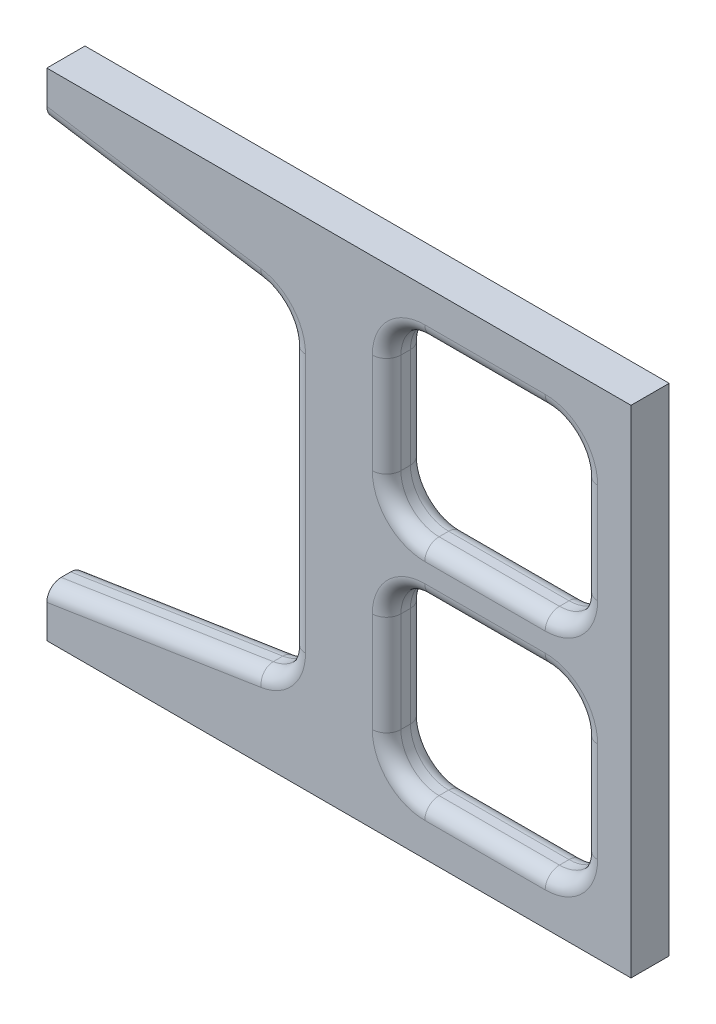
ISO-10303-21;
HEADER;
FILE_DESCRIPTION(('STEP AP214'),'2;1');
FILE_NAME('part.step','',(''),(''),'','','');
FILE_SCHEMA(('AUTOMOTIVE_DESIGN { 1 0 10303 214 1 1 1 1 }'));
ENDSEC;
DATA;
#1=APPLICATION_CONTEXT('core data for automotive mechanical design processes');
#2=APPLICATION_PROTOCOL_DEFINITION('international standard','automotive_design',2000,#1);
#3=PRODUCT_CONTEXT('',#1,'mechanical');
#4=PRODUCT('Part','Part','',(#3));
#5=PRODUCT_RELATED_PRODUCT_CATEGORY('part','',(#4));
#6=PRODUCT_DEFINITION_FORMATION('','',#4);
#7=PRODUCT_DEFINITION_CONTEXT('part definition',#1,'design');
#8=PRODUCT_DEFINITION('design','',#6,#7);
#9=PRODUCT_DEFINITION_SHAPE('','',#8);
#10=(LENGTH_UNIT() NAMED_UNIT(*) SI_UNIT(.MILLI.,.METRE.));
#11=(NAMED_UNIT(*) PLANE_ANGLE_UNIT() SI_UNIT($,.RADIAN.));
#12=(NAMED_UNIT(*) SI_UNIT($,.STERADIAN.) SOLID_ANGLE_UNIT());
#13=UNCERTAINTY_MEASURE_WITH_UNIT(LENGTH_MEASURE(1.E-05),#10,'distance_accuracy_value','');
#14=(GEOMETRIC_REPRESENTATION_CONTEXT(3) GLOBAL_UNCERTAINTY_ASSIGNED_CONTEXT((#13)) GLOBAL_UNIT_ASSIGNED_CONTEXT((#10,
#11,#12)) REPRESENTATION_CONTEXT('',''));
#15=CARTESIAN_POINT('',(0.,0.,0.));
#16=DIRECTION('',(0.,0.,1.));
#17=DIRECTION('',(1.,0.,0.));
#18=AXIS2_PLACEMENT_3D('',#15,#16,#17);
#19=CARTESIAN_POINT('',(-36.,-54.3038025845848,16.));
#20=DIRECTION('',(0.,0.,-1.));
#21=DIRECTION('',(-1.,0.,0.));
#22=AXIS2_PLACEMENT_3D('',#19,#20,#21);
#23=PLANE('',#22);
#24=DIRECTION('',(-1.,0.,0.));
#25=VECTOR('',#24,1.);
#26=CARTESIAN_POINT('',(86.4999999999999,-3.99999999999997,16.));
#27=LINE('',#26,#25);
#28=CARTESIAN_POINT('',(36.0000000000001,-3.99999999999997,16.));
#29=VERTEX_POINT('',#28);
#30=CARTESIAN_POINT('',(86.4999999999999,-3.99999999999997,16.));
#31=VERTEX_POINT('',#30);
#32=EDGE_CURVE('E603',#29,#31,#27,.F.);
#33=ORIENTED_EDGE('',*,*,#32,.T.);
#34=CARTESIAN_POINT('',(86.5,-26.,16.));
#35=DIRECTION('',(0.,0.,-1.));
#36=DIRECTION('',(-1.,0.,0.));
#37=AXIS2_PLACEMENT_3D('',#34,#35,#36);
#38=CIRCLE('',#37,22.);
#39=CARTESIAN_POINT('',(108.5,-26.0000000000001,16.));
#40=VERTEX_POINT('',#39);
#41=EDGE_CURVE('E616',#31,#40,#38,.T.);
#42=ORIENTED_EDGE('',*,*,#41,.T.);
#43=DIRECTION('',(0.,1.,0.));
#44=VECTOR('',#43,1.);
#45=CARTESIAN_POINT('',(108.5,-67.9999999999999,16.));
#46=LINE('',#45,#44);
#47=CARTESIAN_POINT('',(108.5,-67.9999999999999,16.));
#48=VERTEX_POINT('',#47);
#49=EDGE_CURVE('E55',#40,#48,#46,.F.);
#50=ORIENTED_EDGE('',*,*,#49,.T.);
#51=CARTESIAN_POINT('',(86.5,-68.,16.));
#52=DIRECTION('',(0.,0.,-1.));
#53=DIRECTION('',(-1.,0.,0.));
#54=AXIS2_PLACEMENT_3D('',#51,#52,#53);
#55=CIRCLE('',#54,22.);
#56=CARTESIAN_POINT('',(86.4999999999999,-90.,16.));
#57=VERTEX_POINT('',#56);
#58=EDGE_CURVE('E613',#48,#57,#55,.T.);
#59=ORIENTED_EDGE('',*,*,#58,.T.);
#60=DIRECTION('',(1.,0.,0.));
#61=VECTOR('',#60,1.);
#62=CARTESIAN_POINT('',(36.0000000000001,-90.,16.));
#63=LINE('',#62,#61);
#64=CARTESIAN_POINT('',(36.0000000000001,-90.,16.));
#65=VERTEX_POINT('',#64);
#66=EDGE_CURVE('E611',#57,#65,#63,.F.);
#67=ORIENTED_EDGE('',*,*,#66,.T.);
#68=CARTESIAN_POINT('',(36.,-68.,16.));
#69=DIRECTION('',(0.,0.,-1.));
#70=DIRECTION('',(-1.,0.,0.));
#71=AXIS2_PLACEMENT_3D('',#68,#69,#70);
#72=CIRCLE('',#71,22.);
#73=CARTESIAN_POINT('',(14.,-67.9999999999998,16.));
#74=VERTEX_POINT('',#73);
#75=EDGE_CURVE('E609',#65,#74,#72,.T.);
#76=ORIENTED_EDGE('',*,*,#75,.T.);
#77=DIRECTION('',(0.,-1.,0.));
#78=VECTOR('',#77,1.);
#79=CARTESIAN_POINT('',(14.,-26.0000000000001,16.));
#80=LINE('',#79,#78);
#81=CARTESIAN_POINT('',(14.,-26.0000000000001,16.));
#82=VERTEX_POINT('',#81);
#83=EDGE_CURVE('E607',#74,#82,#80,.F.);
#84=ORIENTED_EDGE('',*,*,#83,.T.);
#85=CARTESIAN_POINT('',(36.,-26.,16.));
#86=DIRECTION('',(0.,0.,-1.));
#87=DIRECTION('',(-1.,0.,0.));
#88=AXIS2_PLACEMENT_3D('',#85,#86,#87);
#89=CIRCLE('',#88,22.);
#90=EDGE_CURVE('E605',#82,#29,#89,.T.);
#91=ORIENTED_EDGE('',*,*,#90,.T.);
#92=EDGE_LOOP('',(#33,#42,#50,#59,#67,#76,#84,#91));
#93=FACE_BOUND('',#92,.T.);
#94=DIRECTION('',(0.,-1.,0.));
#95=VECTOR('',#94,1.);
#96=CARTESIAN_POINT('',(14.,67.9999999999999,16.));
#97=LINE('',#96,#95);
#98=CARTESIAN_POINT('',(14.,26.0000000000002,16.));
#99=VERTEX_POINT('',#98);
#100=CARTESIAN_POINT('',(14.,67.9999999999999,16.));
#101=VERTEX_POINT('',#100);
#102=EDGE_CURVE('E416',#99,#101,#97,.F.);
#103=ORIENTED_EDGE('',*,*,#102,.T.);
#104=CARTESIAN_POINT('',(36.,68.,16.));
#105=DIRECTION('',(0.,0.,-1.));
#106=DIRECTION('',(-1.,0.,0.));
#107=AXIS2_PLACEMENT_3D('',#104,#105,#106);
#108=CIRCLE('',#107,22.);
#109=CARTESIAN_POINT('',(36.0000000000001,90.,16.));
#110=VERTEX_POINT('',#109);
#111=EDGE_CURVE('E430',#101,#110,#108,.T.);
#112=ORIENTED_EDGE('',*,*,#111,.T.);
#113=DIRECTION('',(-1.,0.,0.));
#114=VECTOR('',#113,1.);
#115=CARTESIAN_POINT('',(86.4999999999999,90.,16.));
#116=LINE('',#115,#114);
#117=CARTESIAN_POINT('',(86.4999999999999,90.,16.));
#118=VERTEX_POINT('',#117);
#119=EDGE_CURVE('E428',#110,#118,#116,.F.);
#120=ORIENTED_EDGE('',*,*,#119,.T.);
#121=CARTESIAN_POINT('',(86.5,68.,16.));
#122=DIRECTION('',(0.,0.,-1.));
#123=DIRECTION('',(-1.,0.,0.));
#124=AXIS2_PLACEMENT_3D('',#121,#122,#123);
#125=CIRCLE('',#124,22.);
#126=CARTESIAN_POINT('',(108.5,67.9999999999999,16.));
#127=VERTEX_POINT('',#126);
#128=EDGE_CURVE('E426',#118,#127,#125,.T.);
#129=ORIENTED_EDGE('',*,*,#128,.T.);
#130=DIRECTION('',(0.,1.,0.));
#131=VECTOR('',#130,1.);
#132=CARTESIAN_POINT('',(108.5,26.0000000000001,16.));
#133=LINE('',#132,#131);
#134=CARTESIAN_POINT('',(108.5,26.0000000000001,16.));
#135=VERTEX_POINT('',#134);
#136=EDGE_CURVE('E424',#127,#135,#133,.F.);
#137=ORIENTED_EDGE('',*,*,#136,.T.);
#138=CARTESIAN_POINT('',(86.5,26.,16.));
#139=DIRECTION('',(0.,0.,-1.));
#140=DIRECTION('',(-1.,0.,0.));
#141=AXIS2_PLACEMENT_3D('',#138,#139,#140);
#142=CIRCLE('',#141,22.);
#143=CARTESIAN_POINT('',(86.4999999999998,4.00000000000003,16.));
#144=VERTEX_POINT('',#143);
#145=EDGE_CURVE('E422',#135,#144,#142,.T.);
#146=ORIENTED_EDGE('',*,*,#145,.T.);
#147=DIRECTION('',(1.,0.,0.));
#148=VECTOR('',#147,1.);
#149=CARTESIAN_POINT('',(36.0000000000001,4.00000000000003,16.));
#150=LINE('',#149,#148);
#151=CARTESIAN_POINT('',(36.0000000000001,4.00000000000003,16.));
#152=VERTEX_POINT('',#151);
#153=EDGE_CURVE('E420',#144,#152,#150,.F.);
#154=ORIENTED_EDGE('',*,*,#153,.T.);
#155=CARTESIAN_POINT('',(36.,26.,16.));
#156=DIRECTION('',(0.,0.,-1.));
#157=DIRECTION('',(-1.,0.,0.));
#158=AXIS2_PLACEMENT_3D('',#155,#156,#157);
#159=CIRCLE('',#158,22.);
#160=EDGE_CURVE('E418',#152,#99,#159,.T.);
#161=ORIENTED_EDGE('',*,*,#160,.T.);
#162=EDGE_LOOP('',(#103,#112,#120,#129,#137,#146,#154,#161));
#163=FACE_BOUND('',#162,.T.);
#164=CARTESIAN_POINT('',(-36.,-54.3038025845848,16.));
#165=DIRECTION('',(0.,0.,-1.));
#166=DIRECTION('',(-1.,0.,0.));
#167=AXIS2_PLACEMENT_3D('',#164,#165,#166);
#168=CIRCLE('',#167,22.);
#169=CARTESIAN_POINT('',(-14.,-54.3038025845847,16.));
#170=VERTEX_POINT('',#169);
#171=CARTESIAN_POINT('',(-32.6069432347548,-76.0405724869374,16.));
#172=VERTEX_POINT('',#171);
#173=EDGE_CURVE('E524',#170,#172,#168,.T.);
#174=ORIENTED_EDGE('',*,*,#173,.T.);
#175=DIRECTION('',(-0.988034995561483,-0.154229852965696,0.));
#176=VECTOR('',#175,1.);
#177=CARTESIAN_POINT('',(-32.6069432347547,-76.0405724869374,16.));
#178=LINE('',#177,#176);
#179=CARTESIAN_POINT('',(-122.5,-90.0726593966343,16.));
#180=VERTEX_POINT('',#179);
#181=EDGE_CURVE('E526',#172,#180,#178,.T.);
#182=ORIENTED_EDGE('',*,*,#181,.T.);
#183=DIRECTION('',(0.,-1.,0.));
#184=VECTOR('',#183,1.);
#185=CARTESIAN_POINT('',(-122.5,-84.,16.));
#186=LINE('',#185,#184);
#187=CARTESIAN_POINT('',(-122.5,-104.,16.));
#188=VERTEX_POINT('',#187);
#189=EDGE_CURVE('E725',#180,#188,#186,.T.);
#190=ORIENTED_EDGE('',*,*,#189,.T.);
#191=DIRECTION('',(1.,0.,0.));
#192=VECTOR('',#191,1.);
#193=CARTESIAN_POINT('',(-122.5,-104.,16.));
#194=LINE('',#193,#192);
#195=CARTESIAN_POINT('',(122.5,-104.,16.));
#196=VERTEX_POINT('',#195);
#197=EDGE_CURVE('E355',#188,#196,#194,.T.);
#198=ORIENTED_EDGE('',*,*,#197,.T.);
#199=DIRECTION('',(0.,1.,0.));
#200=VECTOR('',#199,1.);
#201=CARTESIAN_POINT('',(122.5,104.,16.));
#202=LINE('',#201,#200);
#203=CARTESIAN_POINT('',(122.5,104.,16.));
#204=VERTEX_POINT('',#203);
#205=EDGE_CURVE('E351',#196,#204,#202,.T.);
#206=ORIENTED_EDGE('',*,*,#205,.T.);
#207=DIRECTION('',(-1.,0.,0.));
#208=VECTOR('',#207,1.);
#209=CARTESIAN_POINT('',(-122.5,104.,16.));
#210=LINE('',#209,#208);
#211=CARTESIAN_POINT('',(-122.5,104.,16.));
#212=VERTEX_POINT('',#211);
#213=EDGE_CURVE('E339',#204,#212,#210,.T.);
#214=ORIENTED_EDGE('',*,*,#213,.T.);
#215=DIRECTION('',(0.,-1.,0.));
#216=VECTOR('',#215,1.);
#217=CARTESIAN_POINT('',(-122.5,104.,16.));
#218=LINE('',#217,#216);
#219=CARTESIAN_POINT('',(-122.5,90.0726593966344,16.));
#220=VERTEX_POINT('',#219);
#221=EDGE_CURVE('E350',#212,#220,#218,.T.);
#222=ORIENTED_EDGE('',*,*,#221,.T.);
#223=DIRECTION('',(0.988034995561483,-0.154229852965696,0.));
#224=VECTOR('',#223,1.);
#225=CARTESIAN_POINT('',(-16.056828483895,73.4571399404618,16.));
#226=LINE('',#225,#224);
#227=CARTESIAN_POINT('',(-32.6069432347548,76.0405724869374,16.));
#228=VERTEX_POINT('',#227);
#229=EDGE_CURVE('E518',#220,#228,#226,.T.);
#230=ORIENTED_EDGE('',*,*,#229,.T.);
#231=CARTESIAN_POINT('',(-36.,54.3038025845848,16.));
#232=DIRECTION('',(0.,0.,-1.));
#233=DIRECTION('',(-1.,0.,0.));
#234=AXIS2_PLACEMENT_3D('',#231,#232,#233);
#235=CIRCLE('',#234,22.);
#236=CARTESIAN_POINT('',(-14.,54.3038025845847,16.));
#237=VERTEX_POINT('',#236);
#238=EDGE_CURVE('E520',#228,#237,#235,.T.);
#239=ORIENTED_EDGE('',*,*,#238,.T.);
#240=DIRECTION('',(0.,-1.,0.));
#241=VECTOR('',#240,1.);
#242=CARTESIAN_POINT('',(-14.,-54.3038025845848,16.));
#243=LINE('',#242,#241);
#244=EDGE_CURVE('E522',#237,#170,#243,.T.);
#245=ORIENTED_EDGE('',*,*,#244,.T.);
#246=EDGE_LOOP('',(#174,#182,#190,#198,#206,#214,#222,#230,#239,#245));
#247=FACE_BOUND('',#246,.T.);
#248=ADVANCED_FACE('F31',(#93,#163,#247),#23,.F.);
#249=CARTESIAN_POINT('',(-36.,-54.3038025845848,0.));
#250=DIRECTION('',(0.,0.,-1.));
#251=DIRECTION('',(-1.,0.,0.));
#252=AXIS2_PLACEMENT_3D('',#249,#250,#251);
#253=PLANE('',#252);
#254=DIRECTION('',(-1.,0.,0.));
#255=VECTOR('',#254,1.);
#256=CARTESIAN_POINT('',(-36.,-3.99999999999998,0.));
#257=LINE('',#256,#255);
#258=CARTESIAN_POINT('',(86.4999999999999,-3.99999999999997,0.));
#259=VERTEX_POINT('',#258);
#260=CARTESIAN_POINT('',(36.0000000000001,-3.99999999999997,0.));
#261=VERTEX_POINT('',#260);
#262=EDGE_CURVE('E568',#259,#261,#257,.T.);
#263=ORIENTED_EDGE('',*,*,#262,.T.);
#264=CARTESIAN_POINT('',(36.,-26.,0.));
#265=DIRECTION('',(0.,0.,-1.));
#266=DIRECTION('',(-1.,0.,0.));
#267=AXIS2_PLACEMENT_3D('',#264,#265,#266);
#268=CIRCLE('',#267,22.);
#269=CARTESIAN_POINT('',(14.,-26.0000000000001,0.));
#270=VERTEX_POINT('',#269);
#271=EDGE_CURVE('E570',#261,#270,#268,.F.);
#272=ORIENTED_EDGE('',*,*,#271,.T.);
#273=DIRECTION('',(0.,-1.,0.));
#274=VECTOR('',#273,1.);
#275=CARTESIAN_POINT('',(14.,-54.3038025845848,0.));
#276=LINE('',#275,#274);
#277=CARTESIAN_POINT('',(14.,-67.9999999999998,0.));
#278=VERTEX_POINT('',#277);
#279=EDGE_CURVE('E533',#270,#278,#276,.T.);
#280=ORIENTED_EDGE('',*,*,#279,.T.);
#281=CARTESIAN_POINT('',(36.,-68.,0.));
#282=DIRECTION('',(0.,0.,-1.));
#283=DIRECTION('',(-1.,0.,0.));
#284=AXIS2_PLACEMENT_3D('',#281,#282,#283);
#285=CIRCLE('',#284,22.);
#286=CARTESIAN_POINT('',(36.0000000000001,-90.,0.));
#287=VERTEX_POINT('',#286);
#288=EDGE_CURVE('E558',#278,#287,#285,.F.);
#289=ORIENTED_EDGE('',*,*,#288,.T.);
#290=DIRECTION('',(1.,0.,0.));
#291=VECTOR('',#290,1.);
#292=CARTESIAN_POINT('',(-36.,-90.,0.));
#293=LINE('',#292,#291);
#294=CARTESIAN_POINT('',(86.4999999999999,-90.,0.));
#295=VERTEX_POINT('',#294);
#296=EDGE_CURVE('E560',#287,#295,#293,.T.);
#297=ORIENTED_EDGE('',*,*,#296,.T.);
#298=CARTESIAN_POINT('',(86.5,-68.,0.));
#299=DIRECTION('',(0.,0.,-1.));
#300=DIRECTION('',(-1.,0.,0.));
#301=AXIS2_PLACEMENT_3D('',#298,#299,#300);
#302=CIRCLE('',#301,22.);
#303=CARTESIAN_POINT('',(108.5,-67.9999999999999,0.));
#304=VERTEX_POINT('',#303);
#305=EDGE_CURVE('E562',#295,#304,#302,.F.);
#306=ORIENTED_EDGE('',*,*,#305,.T.);
#307=DIRECTION('',(0.,1.,0.));
#308=VECTOR('',#307,1.);
#309=CARTESIAN_POINT('',(108.5,-54.3038025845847,0.));
#310=LINE('',#309,#308);
#311=CARTESIAN_POINT('',(108.5,-26.0000000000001,0.));
#312=VERTEX_POINT('',#311);
#313=EDGE_CURVE('E564',#304,#312,#310,.T.);
#314=ORIENTED_EDGE('',*,*,#313,.T.);
#315=CARTESIAN_POINT('',(86.5,-26.,0.));
#316=DIRECTION('',(0.,0.,-1.));
#317=DIRECTION('',(-1.,0.,0.));
#318=AXIS2_PLACEMENT_3D('',#315,#316,#317);
#319=CIRCLE('',#318,22.);
#320=EDGE_CURVE('E566',#312,#259,#319,.F.);
#321=ORIENTED_EDGE('',*,*,#320,.T.);
#322=EDGE_LOOP('',(#263,#272,#280,#289,#297,#306,#314,#321));
#323=FACE_BOUND('',#322,.T.);
#324=DIRECTION('',(-1.,0.,0.));
#325=VECTOR('',#324,1.);
#326=CARTESIAN_POINT('',(-36.,90.,0.));
#327=LINE('',#326,#325);
#328=CARTESIAN_POINT('',(86.4999999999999,90.,0.));
#329=VERTEX_POINT('',#328);
#330=CARTESIAN_POINT('',(36.0000000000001,90.,0.));
#331=VERTEX_POINT('',#330);
#332=EDGE_CURVE('E381',#329,#331,#327,.T.);
#333=ORIENTED_EDGE('',*,*,#332,.T.);
#334=CARTESIAN_POINT('',(36.,68.,0.));
#335=DIRECTION('',(0.,0.,-1.));
#336=DIRECTION('',(-1.,0.,0.));
#337=AXIS2_PLACEMENT_3D('',#334,#335,#336);
#338=CIRCLE('',#337,22.);
#339=CARTESIAN_POINT('',(14.,67.9999999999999,0.));
#340=VERTEX_POINT('',#339);
#341=EDGE_CURVE('E383',#331,#340,#338,.F.);
#342=ORIENTED_EDGE('',*,*,#341,.T.);
#343=DIRECTION('',(0.,-1.,0.));
#344=VECTOR('',#343,1.);
#345=CARTESIAN_POINT('',(14.,-54.3038025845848,0.));
#346=LINE('',#345,#344);
#347=CARTESIAN_POINT('',(14.,26.0000000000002,0.));
#348=VERTEX_POINT('',#347);
#349=EDGE_CURVE('E364',#340,#348,#346,.T.);
#350=ORIENTED_EDGE('',*,*,#349,.T.);
#351=CARTESIAN_POINT('',(36.,26.,0.));
#352=DIRECTION('',(0.,0.,-1.));
#353=DIRECTION('',(-1.,0.,0.));
#354=AXIS2_PLACEMENT_3D('',#351,#352,#353);
#355=CIRCLE('',#354,22.);
#356=CARTESIAN_POINT('',(36.0000000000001,4.00000000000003,0.));
#357=VERTEX_POINT('',#356);
#358=EDGE_CURVE('E366',#348,#357,#355,.F.);
#359=ORIENTED_EDGE('',*,*,#358,.T.);
#360=DIRECTION('',(1.,0.,0.));
#361=VECTOR('',#360,1.);
#362=CARTESIAN_POINT('',(-36.,4.00000000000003,0.));
#363=LINE('',#362,#361);
#364=CARTESIAN_POINT('',(86.4999999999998,4.00000000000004,0.));
#365=VERTEX_POINT('',#364);
#366=EDGE_CURVE('E373',#357,#365,#363,.T.);
#367=ORIENTED_EDGE('',*,*,#366,.T.);
#368=CARTESIAN_POINT('',(86.5,26.,0.));
#369=DIRECTION('',(0.,0.,-1.));
#370=DIRECTION('',(-1.,0.,0.));
#371=AXIS2_PLACEMENT_3D('',#368,#369,#370);
#372=CIRCLE('',#371,22.);
#373=CARTESIAN_POINT('',(108.5,26.0000000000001,0.));
#374=VERTEX_POINT('',#373);
#375=EDGE_CURVE('E375',#365,#374,#372,.F.);
#376=ORIENTED_EDGE('',*,*,#375,.T.);
#377=DIRECTION('',(0.,1.,0.));
#378=VECTOR('',#377,1.);
#379=CARTESIAN_POINT('',(108.5,-54.3038025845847,0.));
#380=LINE('',#379,#378);
#381=CARTESIAN_POINT('',(108.5,67.9999999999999,0.));
#382=VERTEX_POINT('',#381);
#383=EDGE_CURVE('E377',#374,#382,#380,.T.);
#384=ORIENTED_EDGE('',*,*,#383,.T.);
#385=CARTESIAN_POINT('',(86.5,68.,0.));
#386=DIRECTION('',(0.,0.,-1.));
#387=DIRECTION('',(-1.,0.,0.));
#388=AXIS2_PLACEMENT_3D('',#385,#386,#387);
#389=CIRCLE('',#388,22.);
#390=EDGE_CURVE('E379',#382,#329,#389,.F.);
#391=ORIENTED_EDGE('',*,*,#390,.T.);
#392=EDGE_LOOP('',(#333,#342,#350,#359,#367,#376,#384,#391));
#393=FACE_BOUND('',#392,.T.);
#394=CARTESIAN_POINT('',(-36.,54.3038025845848,0.));
#395=DIRECTION('',(0.,0.,-1.));
#396=DIRECTION('',(-1.,0.,0.));
#397=AXIS2_PLACEMENT_3D('',#394,#395,#396);
#398=CIRCLE('',#397,22.);
#399=CARTESIAN_POINT('',(-14.,54.3038025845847,0.));
#400=VERTEX_POINT('',#399);
#401=CARTESIAN_POINT('',(-32.6069432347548,76.0405724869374,0.));
#402=VERTEX_POINT('',#401);
#403=EDGE_CURVE('E494',#400,#402,#398,.F.);
#404=ORIENTED_EDGE('',*,*,#403,.T.);
#405=DIRECTION('',(0.988034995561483,-0.154229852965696,0.));
#406=VECTOR('',#405,1.);
#407=CARTESIAN_POINT('',(-121.574620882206,89.9282099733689,0.));
#408=LINE('',#407,#406);
#409=CARTESIAN_POINT('',(-122.5,90.0726593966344,0.));
#410=VERTEX_POINT('',#409);
#411=EDGE_CURVE('E496',#402,#410,#408,.F.);
#412=ORIENTED_EDGE('',*,*,#411,.T.);
#413=DIRECTION('',(0.,-1.,0.));
#414=VECTOR('',#413,1.);
#415=CARTESIAN_POINT('',(-122.5,104.,0.));
#416=LINE('',#415,#414);
#417=CARTESIAN_POINT('',(-122.5,104.,0.));
#418=VERTEX_POINT('',#417);
#419=EDGE_CURVE('E732',#418,#410,#416,.T.);
#420=ORIENTED_EDGE('',*,*,#419,.F.);
#421=DIRECTION('',(-1.,0.,0.));
#422=VECTOR('',#421,1.);
#423=CARTESIAN_POINT('',(-122.5,104.,0.));
#424=LINE('',#423,#422);
#425=CARTESIAN_POINT('',(122.5,104.,0.));
#426=VERTEX_POINT('',#425);
#427=EDGE_CURVE('E730',#426,#418,#424,.T.);
#428=ORIENTED_EDGE('',*,*,#427,.F.);
#429=DIRECTION('',(0.,1.,0.));
#430=VECTOR('',#429,1.);
#431=CARTESIAN_POINT('',(122.5,104.,0.));
#432=LINE('',#431,#430);
#433=CARTESIAN_POINT('',(122.5,-104.,0.));
#434=VERTEX_POINT('',#433);
#435=EDGE_CURVE('E363',#434,#426,#432,.T.);
#436=ORIENTED_EDGE('',*,*,#435,.F.);
#437=DIRECTION('',(1.,0.,0.));
#438=VECTOR('',#437,1.);
#439=CARTESIAN_POINT('',(-122.5,-104.,0.));
#440=LINE('',#439,#438);
#441=CARTESIAN_POINT('',(-122.5,-104.,0.));
#442=VERTEX_POINT('',#441);
#443=EDGE_CURVE('E359',#442,#434,#440,.T.);
#444=ORIENTED_EDGE('',*,*,#443,.F.);
#445=DIRECTION('',(0.,-1.,0.));
#446=VECTOR('',#445,1.);
#447=CARTESIAN_POINT('',(-122.5,-84.,0.));
#448=LINE('',#447,#446);
#449=CARTESIAN_POINT('',(-122.5,-90.0726593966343,0.));
#450=VERTEX_POINT('',#449);
#451=EDGE_CURVE('E735',#450,#442,#448,.T.);
#452=ORIENTED_EDGE('',*,*,#451,.F.);
#453=DIRECTION('',(-0.988034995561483,-0.154229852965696,0.));
#454=VECTOR('',#453,1.);
#455=CARTESIAN_POINT('',(-32.6069432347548,-76.0405724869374,0.));
#456=LINE('',#455,#454);
#457=CARTESIAN_POINT('',(-32.6069432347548,-76.0405724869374,0.));
#458=VERTEX_POINT('',#457);
#459=EDGE_CURVE('E492',#450,#458,#456,.F.);
#460=ORIENTED_EDGE('',*,*,#459,.T.);
#461=CARTESIAN_POINT('',(-36.,-54.3038025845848,0.));
#462=DIRECTION('',(0.,0.,-1.));
#463=DIRECTION('',(-1.,0.,0.));
#464=AXIS2_PLACEMENT_3D('',#461,#462,#463);
#465=CIRCLE('',#464,22.);
#466=CARTESIAN_POINT('',(-14.,-54.3038025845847,0.));
#467=VERTEX_POINT('',#466);
#468=EDGE_CURVE('E490',#458,#467,#465,.F.);
#469=ORIENTED_EDGE('',*,*,#468,.T.);
#470=DIRECTION('',(0.,-1.,0.));
#471=VECTOR('',#470,1.);
#472=CARTESIAN_POINT('',(-14.,54.3038025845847,0.));
#473=LINE('',#472,#471);
#474=EDGE_CURVE('E488',#467,#400,#473,.F.);
#475=ORIENTED_EDGE('',*,*,#474,.T.);
#476=EDGE_LOOP('',(#404,#412,#420,#428,#436,#444,#452,#460,#469,#475));
#477=FACE_BOUND('',#476,.T.);
#478=ADVANCED_FACE('F812',(#323,#393,#477),#253,.T.);
#479=CARTESIAN_POINT('',(122.5,104.,16.));
#480=DIRECTION('',(-1.,0.,0.));
#481=DIRECTION('',(0.,-1.,0.));
#482=AXIS2_PLACEMENT_3D('',#479,#480,#481);
#483=PLANE('',#482);
#484=ORIENTED_EDGE('',*,*,#435,.T.);
#485=DIRECTION('',(0.,0.,-1.));
#486=VECTOR('',#485,1.);
#487=CARTESIAN_POINT('',(122.5,104.,16.));
#488=LINE('',#487,#486);
#489=EDGE_CURVE('E343',#204,#426,#488,.T.);
#490=ORIENTED_EDGE('',*,*,#489,.F.);
#491=ORIENTED_EDGE('',*,*,#205,.F.);
#492=DIRECTION('',(0.,0.,-1.));
#493=VECTOR('',#492,1.);
#494=CARTESIAN_POINT('',(122.5,-104.,16.));
#495=LINE('',#494,#493);
#496=EDGE_CURVE('E728',#196,#434,#495,.T.);
#497=ORIENTED_EDGE('',*,*,#496,.T.);
#498=EDGE_LOOP('',(#484,#490,#491,#497));
#499=FACE_BOUND('',#498,.T.);
#500=ADVANCED_FACE('F361',(#499),#483,.F.);
#501=CARTESIAN_POINT('',(-122.5,104.,16.));
#502=DIRECTION('',(0.,-1.,0.));
#503=DIRECTION('',(0.,0.,-1.));
#504=AXIS2_PLACEMENT_3D('',#501,#502,#503);
#505=PLANE('',#504);
#506=ORIENTED_EDGE('',*,*,#427,.T.);
#507=DIRECTION('',(0.,0.,-1.));
#508=VECTOR('',#507,1.);
#509=CARTESIAN_POINT('',(-122.5,104.,16.));
#510=LINE('',#509,#508);
#511=EDGE_CURVE('E346',#212,#418,#510,.T.);
#512=ORIENTED_EDGE('',*,*,#511,.F.);
#513=ORIENTED_EDGE('',*,*,#213,.F.);
#514=ORIENTED_EDGE('',*,*,#489,.T.);
#515=EDGE_LOOP('',(#506,#512,#513,#514));
#516=FACE_BOUND('',#515,.T.);
#517=ADVANCED_FACE('F341',(#516),#505,.F.);
#518=CARTESIAN_POINT('',(-122.5,104.,16.));
#519=DIRECTION('',(1.,0.,0.));
#520=DIRECTION('',(0.,0.,-1.));
#521=AXIS2_PLACEMENT_3D('',#518,#519,#520);
#522=PLANE('',#521);
#523=ORIENTED_EDGE('',*,*,#419,.T.);
#524=CARTESIAN_POINT('',(-122.5,90.0726593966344,6.));
#525=DIRECTION('',(1.,0.,0.));
#526=DIRECTION('',(0.,1.,0.));
#527=AXIS2_PLACEMENT_3D('',#524,#525,#526);
#528=ELLIPSE('',#527,6.07265939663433,6.);
#529=CARTESIAN_POINT('',(-122.5,84.,6.));
#530=VERTEX_POINT('',#529);
#531=EDGE_CURVE('E500',#410,#530,#528,.F.);
#532=ORIENTED_EDGE('',*,*,#531,.T.);
#533=DIRECTION('',(0.,0.,-1.));
#534=VECTOR('',#533,1.);
#535=CARTESIAN_POINT('',(-122.5,84.,16.));
#536=LINE('',#535,#534);
#537=CARTESIAN_POINT('',(-122.5,84.,10.));
#538=VERTEX_POINT('',#537);
#539=EDGE_CURVE('E368',#538,#530,#536,.T.);
#540=ORIENTED_EDGE('',*,*,#539,.F.);
#541=CARTESIAN_POINT('',(-122.5,90.0726593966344,10.));
#542=DIRECTION('',(1.,0.,0.));
#543=DIRECTION('',(0.,-1.,0.));
#544=AXIS2_PLACEMENT_3D('',#541,#542,#543);
#545=ELLIPSE('',#544,6.07265939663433,6.);
#546=EDGE_CURVE('E498',#538,#220,#545,.F.);
#547=ORIENTED_EDGE('',*,*,#546,.T.);
#548=ORIENTED_EDGE('',*,*,#221,.F.);
#549=ORIENTED_EDGE('',*,*,#511,.T.);
#550=EDGE_LOOP('',(#523,#532,#540,#547,#548,#549));
#551=FACE_BOUND('',#550,.T.);
#552=ADVANCED_FACE('F835',(#551),#522,.F.);
#553=CARTESIAN_POINT('',(-33.532322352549,70.1123625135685,16.));
#554=DIRECTION('',(0.154229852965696,0.988034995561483,0.));
#555=DIRECTION('',(-0.988034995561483,0.154229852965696,0.));
#556=AXIS2_PLACEMENT_3D('',#553,#554,#555);
#557=PLANE('',#556);
#558=ORIENTED_EDGE('',*,*,#539,.T.);
#559=DIRECTION('',(0.988034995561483,-0.154229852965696,0.));
#560=VECTOR('',#559,1.);
#561=CARTESIAN_POINT('',(-33.532322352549,70.1123625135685,6.));
#562=LINE('',#561,#560);
#563=CARTESIAN_POINT('',(-33.532322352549,70.1123625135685,6.));
#564=VERTEX_POINT('',#563);
#565=EDGE_CURVE('E485',#530,#564,#562,.T.);
#566=ORIENTED_EDGE('',*,*,#565,.T.);
#567=DIRECTION('',(0.,0.,-1.));
#568=VECTOR('',#567,1.);
#569=CARTESIAN_POINT('',(-33.532322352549,70.1123625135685,16.));
#570=LINE('',#569,#568);
#571=CARTESIAN_POINT('',(-33.532322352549,70.1123625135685,10.));
#572=VERTEX_POINT('',#571);
#573=EDGE_CURVE('E754',#572,#564,#570,.T.);
#574=ORIENTED_EDGE('',*,*,#573,.F.);
#575=DIRECTION('',(0.988034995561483,-0.154229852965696,0.));
#576=VECTOR('',#575,1.);
#577=CARTESIAN_POINT('',(-33.532322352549,70.1123625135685,10.));
#578=LINE('',#577,#576);
#579=EDGE_CURVE('E437',#572,#538,#578,.F.);
#580=ORIENTED_EDGE('',*,*,#579,.T.);
#581=EDGE_LOOP('',(#558,#566,#574,#580));
#582=FACE_BOUND('',#581,.T.);
#583=ADVANCED_FACE('F760',(#582),#557,.F.);
#584=CARTESIAN_POINT('',(-36.,54.3038025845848,16.));
#585=DIRECTION('',(0.,0.,-1.));
#586=DIRECTION('',(-1.,0.,0.));
#587=AXIS2_PLACEMENT_3D('',#584,#585,#586);
#588=CYLINDRICAL_SURFACE('',#587,16.);
#589=ORIENTED_EDGE('',*,*,#573,.T.);
#590=CARTESIAN_POINT('',(-36.,54.3038025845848,6.));
#591=DIRECTION('',(0.,0.,-1.));
#592=DIRECTION('',(-1.,0.,0.));
#593=AXIS2_PLACEMENT_3D('',#590,#591,#592);
#594=CIRCLE('',#593,16.);
#595=CARTESIAN_POINT('',(-20.,54.3038025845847,6.));
#596=VERTEX_POINT('',#595);
#597=EDGE_CURVE('E504',#564,#596,#594,.T.);
#598=ORIENTED_EDGE('',*,*,#597,.T.);
#599=DIRECTION('',(0.,0.,-1.));
#600=VECTOR('',#599,1.);
#601=CARTESIAN_POINT('',(-20.,54.3038025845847,16.));
#602=LINE('',#601,#600);
#603=CARTESIAN_POINT('',(-20.,54.3038025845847,10.));
#604=VERTEX_POINT('',#603);
#605=EDGE_CURVE('E751',#604,#596,#602,.T.);
#606=ORIENTED_EDGE('',*,*,#605,.F.);
#607=CARTESIAN_POINT('',(-36.,54.3038025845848,10.));
#608=DIRECTION('',(0.,0.,-1.));
#609=DIRECTION('',(-1.,0.,0.));
#610=AXIS2_PLACEMENT_3D('',#607,#608,#609);
#611=CIRCLE('',#610,16.);
#612=EDGE_CURVE('E502',#604,#572,#611,.F.);
#613=ORIENTED_EDGE('',*,*,#612,.T.);
#614=EDGE_LOOP('',(#589,#598,#606,#613));
#615=FACE_BOUND('',#614,.T.);
#616=ADVANCED_FACE('F777',(#615),#588,.F.);
#617=CARTESIAN_POINT('',(-20.,-54.3038025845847,16.));
#618=DIRECTION('',(1.,0.,0.));
#619=DIRECTION('',(0.,0.,-1.));
#620=AXIS2_PLACEMENT_3D('',#617,#618,#619);
#621=PLANE('',#620);
#622=DIRECTION('',(0.,0.,-1.));
#623=VECTOR('',#622,1.);
#624=CARTESIAN_POINT('',(-20.,-54.3038025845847,16.));
#625=LINE('',#624,#623);
#626=CARTESIAN_POINT('',(-20.,-54.3038025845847,10.));
#627=VERTEX_POINT('',#626);
#628=CARTESIAN_POINT('',(-20.,-54.3038025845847,6.));
#629=VERTEX_POINT('',#628);
#630=EDGE_CURVE('E748',#627,#629,#625,.T.);
#631=ORIENTED_EDGE('',*,*,#630,.F.);
#632=DIRECTION('',(0.,-1.,0.));
#633=VECTOR('',#632,1.);
#634=CARTESIAN_POINT('',(-20.,-54.3038025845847,10.));
#635=LINE('',#634,#633);
#636=EDGE_CURVE('E531',#627,#604,#635,.F.);
#637=ORIENTED_EDGE('',*,*,#636,.T.);
#638=ORIENTED_EDGE('',*,*,#605,.T.);
#639=DIRECTION('',(0.,-1.,0.));
#640=VECTOR('',#639,1.);
#641=CARTESIAN_POINT('',(-20.,-54.3038025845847,6.));
#642=LINE('',#641,#640);
#643=EDGE_CURVE('E529',#596,#629,#642,.T.);
#644=ORIENTED_EDGE('',*,*,#643,.T.);
#645=EDGE_LOOP('',(#631,#637,#638,#644));
#646=FACE_BOUND('',#645,.T.);
#647=ADVANCED_FACE('F782',(#646),#621,.F.);
#648=CARTESIAN_POINT('',(-36.,-54.3038025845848,16.));
#649=DIRECTION('',(0.,0.,-1.));
#650=DIRECTION('',(-1.,0.,0.));
#651=AXIS2_PLACEMENT_3D('',#648,#649,#650);
#652=CYLINDRICAL_SURFACE('',#651,16.);
#653=ORIENTED_EDGE('',*,*,#630,.T.);
#654=CARTESIAN_POINT('',(-36.,-54.3038025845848,6.));
#655=DIRECTION('',(0.,0.,-1.));
#656=DIRECTION('',(-1.,0.,0.));
#657=AXIS2_PLACEMENT_3D('',#654,#655,#656);
#658=CIRCLE('',#657,16.);
#659=CARTESIAN_POINT('',(-33.532322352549,-70.1123625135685,6.));
#660=VERTEX_POINT('',#659);
#661=EDGE_CURVE('E516',#629,#660,#658,.T.);
#662=ORIENTED_EDGE('',*,*,#661,.T.);
#663=DIRECTION('',(0.,0.,-1.));
#664=VECTOR('',#663,1.);
#665=CARTESIAN_POINT('',(-33.532322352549,-70.1123625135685,16.));
#666=LINE('',#665,#664);
#667=CARTESIAN_POINT('',(-33.532322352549,-70.1123625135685,10.));
#668=VERTEX_POINT('',#667);
#669=EDGE_CURVE('E745',#668,#660,#666,.T.);
#670=ORIENTED_EDGE('',*,*,#669,.F.);
#671=CARTESIAN_POINT('',(-36.,-54.3038025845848,10.));
#672=DIRECTION('',(0.,0.,-1.));
#673=DIRECTION('',(-1.,0.,0.));
#674=AXIS2_PLACEMENT_3D('',#671,#672,#673);
#675=CIRCLE('',#674,16.);
#676=EDGE_CURVE('E514',#668,#627,#675,.F.);
#677=ORIENTED_EDGE('',*,*,#676,.T.);
#678=EDGE_LOOP('',(#653,#662,#670,#677));
#679=FACE_BOUND('',#678,.T.);
#680=ADVANCED_FACE('F795',(#679),#652,.F.);
#681=CARTESIAN_POINT('',(-33.532322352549,-70.1123625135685,16.));
#682=DIRECTION('',(0.154229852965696,-0.988034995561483,0.));
#683=DIRECTION('',(0.988034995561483,0.154229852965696,0.));
#684=AXIS2_PLACEMENT_3D('',#681,#682,#683);
#685=PLANE('',#684);
#686=ORIENTED_EDGE('',*,*,#669,.T.);
#687=DIRECTION('',(-0.988034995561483,-0.154229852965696,0.));
#688=VECTOR('',#687,1.);
#689=CARTESIAN_POINT('',(-122.5,-84.,6.));
#690=LINE('',#689,#688);
#691=CARTESIAN_POINT('',(-122.5,-84.,6.));
#692=VERTEX_POINT('',#691);
#693=EDGE_CURVE('E508',#660,#692,#690,.T.);
#694=ORIENTED_EDGE('',*,*,#693,.T.);
#695=DIRECTION('',(0.,0.,-1.));
#696=VECTOR('',#695,1.);
#697=CARTESIAN_POINT('',(-122.5,-84.,16.));
#698=LINE('',#697,#696);
#699=CARTESIAN_POINT('',(-122.5,-84.,10.));
#700=VERTEX_POINT('',#699);
#701=EDGE_CURVE('E742',#700,#692,#698,.T.);
#702=ORIENTED_EDGE('',*,*,#701,.F.);
#703=DIRECTION('',(-0.988034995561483,-0.154229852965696,0.));
#704=VECTOR('',#703,1.);
#705=CARTESIAN_POINT('',(-33.532322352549,-70.1123625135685,10.));
#706=LINE('',#705,#704);
#707=EDGE_CURVE('E506',#700,#668,#706,.F.);
#708=ORIENTED_EDGE('',*,*,#707,.T.);
#709=EDGE_LOOP('',(#686,#694,#702,#708));
#710=FACE_BOUND('',#709,.T.);
#711=ADVANCED_FACE('F799',(#710),#685,.F.);
#712=CARTESIAN_POINT('',(-122.5,-84.,16.));
#713=DIRECTION('',(1.,0.,0.));
#714=DIRECTION('',(0.,0.,-1.));
#715=AXIS2_PLACEMENT_3D('',#712,#713,#714);
#716=PLANE('',#715);
#717=ORIENTED_EDGE('',*,*,#701,.T.);
#718=CARTESIAN_POINT('',(-122.5,-90.0726593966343,6.));
#719=DIRECTION('',(1.,0.,0.));
#720=DIRECTION('',(0.,1.,0.));
#721=AXIS2_PLACEMENT_3D('',#718,#719,#720);
#722=ELLIPSE('',#721,6.07265939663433,6.);
#723=EDGE_CURVE('E512',#692,#450,#722,.F.);
#724=ORIENTED_EDGE('',*,*,#723,.T.);
#725=ORIENTED_EDGE('',*,*,#451,.T.);
#726=DIRECTION('',(0.,0.,-1.));
#727=VECTOR('',#726,1.);
#728=CARTESIAN_POINT('',(-122.5,-104.,16.));
#729=LINE('',#728,#727);
#730=EDGE_CURVE('E739',#188,#442,#729,.T.);
#731=ORIENTED_EDGE('',*,*,#730,.F.);
#732=ORIENTED_EDGE('',*,*,#189,.F.);
#733=CARTESIAN_POINT('',(-122.5,-90.0726593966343,10.));
#734=DIRECTION('',(1.,0.,0.));
#735=DIRECTION('',(0.,-1.,0.));
#736=AXIS2_PLACEMENT_3D('',#733,#734,#735);
#737=ELLIPSE('',#736,6.07265939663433,6.);
#738=EDGE_CURVE('E510',#180,#700,#737,.F.);
#739=ORIENTED_EDGE('',*,*,#738,.T.);
#740=EDGE_LOOP('',(#717,#724,#725,#731,#732,#739));
#741=FACE_BOUND('',#740,.T.);
#742=ADVANCED_FACE('F808',(#741),#716,.F.);
#743=CARTESIAN_POINT('',(-122.5,-104.,16.));
#744=DIRECTION('',(0.,1.,0.));
#745=DIRECTION('',(-1.,0.,0.));
#746=AXIS2_PLACEMENT_3D('',#743,#744,#745);
#747=PLANE('',#746);
#748=ORIENTED_EDGE('',*,*,#443,.T.);
#749=ORIENTED_EDGE('',*,*,#496,.F.);
#750=ORIENTED_EDGE('',*,*,#197,.F.);
#751=ORIENTED_EDGE('',*,*,#730,.T.);
#752=EDGE_LOOP('',(#748,#749,#750,#751));
#753=FACE_BOUND('',#752,.T.);
#754=ADVANCED_FACE('F814',(#753),#747,.F.);
#755=CARTESIAN_POINT('',(36.,68.,16.));
#756=DIRECTION('',(0.,0.,-1.));
#757=DIRECTION('',(-1.,0.,0.));
#758=AXIS2_PLACEMENT_3D('',#755,#756,#757);
#759=CYLINDRICAL_SURFACE('',#758,16.);
#760=DIRECTION('',(0.,0.,-1.));
#761=VECTOR('',#760,1.);
#762=CARTESIAN_POINT('',(20.,67.9999999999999,16.));
#763=LINE('',#762,#761);
#764=CARTESIAN_POINT('',(20.,67.9999999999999,10.));
#765=VERTEX_POINT('',#764);
#766=CARTESIAN_POINT('',(20.,67.9999999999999,6.));
#767=VERTEX_POINT('',#766);
#768=EDGE_CURVE('E721',#765,#767,#763,.T.);
#769=ORIENTED_EDGE('',*,*,#768,.T.);
#770=CARTESIAN_POINT('',(36.,68.,6.));
#771=DIRECTION('',(0.,0.,-1.));
#772=DIRECTION('',(-1.,0.,0.));
#773=AXIS2_PLACEMENT_3D('',#770,#771,#772);
#774=CIRCLE('',#773,16.);
#775=CARTESIAN_POINT('',(36.0000000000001,84.,6.));
#776=VERTEX_POINT('',#775);
#777=EDGE_CURVE('E389',#767,#776,#774,.T.);
#778=ORIENTED_EDGE('',*,*,#777,.T.);
#779=DIRECTION('',(0.,0.,-1.));
#780=VECTOR('',#779,1.);
#781=CARTESIAN_POINT('',(36.0000000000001,84.,16.));
#782=LINE('',#781,#780);
#783=CARTESIAN_POINT('',(36.0000000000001,84.,10.));
#784=VERTEX_POINT('',#783);
#785=EDGE_CURVE('E695',#784,#776,#782,.T.);
#786=ORIENTED_EDGE('',*,*,#785,.F.);
#787=CARTESIAN_POINT('',(36.,68.,10.));
#788=DIRECTION('',(0.,0.,-1.));
#789=DIRECTION('',(-1.,0.,0.));
#790=AXIS2_PLACEMENT_3D('',#787,#788,#789);
#791=CIRCLE('',#790,16.);
#792=EDGE_CURVE('E386',#784,#765,#791,.F.);
#793=ORIENTED_EDGE('',*,*,#792,.T.);
#794=EDGE_LOOP('',(#769,#778,#786,#793));
#795=FACE_BOUND('',#794,.T.);
#796=ADVANCED_FACE('F853',(#795),#759,.F.);
#797=CARTESIAN_POINT('',(20.,67.9999999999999,16.));
#798=DIRECTION('',(1.,0.,0.));
#799=DIRECTION('',(0.,1.,0.));
#800=AXIS2_PLACEMENT_3D('',#797,#798,#799);
#801=PLANE('',#800);
#802=DIRECTION('',(0.,0.,-1.));
#803=VECTOR('',#802,1.);
#804=CARTESIAN_POINT('',(20.,26.0000000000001,16.));
#805=LINE('',#804,#803);
#806=CARTESIAN_POINT('',(20.,26.0000000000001,10.));
#807=VERTEX_POINT('',#806);
#808=CARTESIAN_POINT('',(20.,26.0000000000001,6.));
#809=VERTEX_POINT('',#808);
#810=EDGE_CURVE('E718',#807,#809,#805,.T.);
#811=ORIENTED_EDGE('',*,*,#810,.T.);
#812=DIRECTION('',(0.,-1.,0.));
#813=VECTOR('',#812,1.);
#814=CARTESIAN_POINT('',(20.,67.9999999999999,6.));
#815=LINE('',#814,#813);
#816=EDGE_CURVE('E435',#809,#767,#815,.F.);
#817=ORIENTED_EDGE('',*,*,#816,.T.);
#818=ORIENTED_EDGE('',*,*,#768,.F.);
#819=DIRECTION('',(0.,-1.,0.));
#820=VECTOR('',#819,1.);
#821=CARTESIAN_POINT('',(20.,26.0000000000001,10.));
#822=LINE('',#821,#820);
#823=EDGE_CURVE('E433',#765,#807,#822,.T.);
#824=ORIENTED_EDGE('',*,*,#823,.T.);
#825=EDGE_LOOP('',(#811,#817,#818,#824));
#826=FACE_BOUND('',#825,.T.);
#827=ADVANCED_FACE('F899',(#826),#801,.T.);
#828=CARTESIAN_POINT('',(36.,26.,16.));
#829=DIRECTION('',(0.,0.,-1.));
#830=DIRECTION('',(-1.,0.,0.));
#831=AXIS2_PLACEMENT_3D('',#828,#829,#830);
#832=CYLINDRICAL_SURFACE('',#831,16.);
#833=DIRECTION('',(0.,0.,-1.));
#834=VECTOR('',#833,1.);
#835=CARTESIAN_POINT('',(36.0000000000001,10.,16.));
#836=LINE('',#835,#834);
#837=CARTESIAN_POINT('',(36.0000000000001,10.,10.));
#838=VERTEX_POINT('',#837);
#839=CARTESIAN_POINT('',(36.0000000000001,10.,6.));
#840=VERTEX_POINT('',#839);
#841=EDGE_CURVE('E715',#838,#840,#836,.T.);
#842=ORIENTED_EDGE('',*,*,#841,.T.);
#843=CARTESIAN_POINT('',(36.,26.,6.));
#844=DIRECTION('',(0.,0.,-1.));
#845=DIRECTION('',(-1.,0.,0.));
#846=AXIS2_PLACEMENT_3D('',#843,#844,#845);
#847=CIRCLE('',#846,16.);
#848=EDGE_CURVE('E414',#840,#809,#847,.T.);
#849=ORIENTED_EDGE('',*,*,#848,.T.);
#850=ORIENTED_EDGE('',*,*,#810,.F.);
#851=CARTESIAN_POINT('',(36.,26.,10.));
#852=DIRECTION('',(0.,0.,-1.));
#853=DIRECTION('',(-1.,0.,0.));
#854=AXIS2_PLACEMENT_3D('',#851,#852,#853);
#855=CIRCLE('',#854,16.);
#856=EDGE_CURVE('E412',#807,#838,#855,.F.);
#857=ORIENTED_EDGE('',*,*,#856,.T.);
#858=EDGE_LOOP('',(#842,#849,#850,#857));
#859=FACE_BOUND('',#858,.T.);
#860=ADVANCED_FACE('F906',(#859),#832,.F.);
#861=CARTESIAN_POINT('',(36.0000000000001,10.,16.));
#862=DIRECTION('',(0.,1.,0.));
#863=DIRECTION('',(-1.,0.,0.));
#864=AXIS2_PLACEMENT_3D('',#861,#862,#863);
#865=PLANE('',#864);
#866=DIRECTION('',(0.,0.,-1.));
#867=VECTOR('',#866,1.);
#868=CARTESIAN_POINT('',(86.4999999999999,10.,16.));
#869=LINE('',#868,#867);
#870=CARTESIAN_POINT('',(86.4999999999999,10.,10.));
#871=VERTEX_POINT('',#870);
#872=CARTESIAN_POINT('',(86.4999999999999,10.,6.));
#873=VERTEX_POINT('',#872);
#874=EDGE_CURVE('E712',#871,#873,#869,.T.);
#875=ORIENTED_EDGE('',*,*,#874,.T.);
#876=DIRECTION('',(1.,0.,0.));
#877=VECTOR('',#876,1.);
#878=CARTESIAN_POINT('',(36.0000000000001,10.,6.));
#879=LINE('',#878,#877);
#880=EDGE_CURVE('E410',#873,#840,#879,.F.);
#881=ORIENTED_EDGE('',*,*,#880,.T.);
#882=ORIENTED_EDGE('',*,*,#841,.F.);
#883=DIRECTION('',(1.,0.,0.));
#884=VECTOR('',#883,1.);
#885=CARTESIAN_POINT('',(86.4999999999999,10.,10.));
#886=LINE('',#885,#884);
#887=EDGE_CURVE('E408',#838,#871,#886,.T.);
#888=ORIENTED_EDGE('',*,*,#887,.T.);
#889=EDGE_LOOP('',(#875,#881,#882,#888));
#890=FACE_BOUND('',#889,.T.);
#891=ADVANCED_FACE('F913',(#890),#865,.T.);
#892=CARTESIAN_POINT('',(86.5,26.,16.));
#893=DIRECTION('',(0.,0.,-1.));
#894=DIRECTION('',(-1.,0.,0.));
#895=AXIS2_PLACEMENT_3D('',#892,#893,#894);
#896=CYLINDRICAL_SURFACE('',#895,16.);
#897=DIRECTION('',(0.,0.,-1.));
#898=VECTOR('',#897,1.);
#899=CARTESIAN_POINT('',(102.5,26.0000000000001,16.));
#900=LINE('',#899,#898);
#901=CARTESIAN_POINT('',(102.5,26.0000000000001,10.));
#902=VERTEX_POINT('',#901);
#903=CARTESIAN_POINT('',(102.5,26.0000000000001,6.));
#904=VERTEX_POINT('',#903);
#905=EDGE_CURVE('E709',#902,#904,#900,.T.);
#906=ORIENTED_EDGE('',*,*,#905,.T.);
#907=CARTESIAN_POINT('',(86.5,26.,6.));
#908=DIRECTION('',(0.,0.,-1.));
#909=DIRECTION('',(-1.,0.,0.));
#910=AXIS2_PLACEMENT_3D('',#907,#908,#909);
#911=CIRCLE('',#910,16.);
#912=EDGE_CURVE('E406',#904,#873,#911,.T.);
#913=ORIENTED_EDGE('',*,*,#912,.T.);
#914=ORIENTED_EDGE('',*,*,#874,.F.);
#915=CARTESIAN_POINT('',(86.5,26.,10.));
#916=DIRECTION('',(0.,0.,-1.));
#917=DIRECTION('',(-1.,0.,0.));
#918=AXIS2_PLACEMENT_3D('',#915,#916,#917);
#919=CIRCLE('',#918,16.);
#920=EDGE_CURVE('E404',#871,#902,#919,.F.);
#921=ORIENTED_EDGE('',*,*,#920,.T.);
#922=EDGE_LOOP('',(#906,#913,#914,#921));
#923=FACE_BOUND('',#922,.T.);
#924=ADVANCED_FACE('F921',(#923),#896,.F.);
#925=CARTESIAN_POINT('',(102.5,67.9999999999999,16.));
#926=DIRECTION('',(-1.,0.,0.));
#927=DIRECTION('',(0.,-1.,0.));
#928=AXIS2_PLACEMENT_3D('',#925,#926,#927);
#929=PLANE('',#928);
#930=DIRECTION('',(0.,0.,-1.));
#931=VECTOR('',#930,1.);
#932=CARTESIAN_POINT('',(102.5,67.9999999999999,16.));
#933=LINE('',#932,#931);
#934=CARTESIAN_POINT('',(102.5,67.9999999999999,10.));
#935=VERTEX_POINT('',#934);
#936=CARTESIAN_POINT('',(102.5,67.9999999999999,6.));
#937=VERTEX_POINT('',#936);
#938=EDGE_CURVE('E706',#935,#937,#933,.T.);
#939=ORIENTED_EDGE('',*,*,#938,.T.);
#940=DIRECTION('',(0.,1.,0.));
#941=VECTOR('',#940,1.);
#942=CARTESIAN_POINT('',(102.5,67.9999999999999,6.));
#943=LINE('',#942,#941);
#944=EDGE_CURVE('E402',#937,#904,#943,.F.);
#945=ORIENTED_EDGE('',*,*,#944,.T.);
#946=ORIENTED_EDGE('',*,*,#905,.F.);
#947=DIRECTION('',(0.,1.,0.));
#948=VECTOR('',#947,1.);
#949=CARTESIAN_POINT('',(102.5,67.9999999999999,10.));
#950=LINE('',#949,#948);
#951=EDGE_CURVE('E400',#902,#935,#950,.T.);
#952=ORIENTED_EDGE('',*,*,#951,.T.);
#953=EDGE_LOOP('',(#939,#945,#946,#952));
#954=FACE_BOUND('',#953,.T.);
#955=ADVANCED_FACE('F929',(#954),#929,.T.);
#956=CARTESIAN_POINT('',(86.5,68.,16.));
#957=DIRECTION('',(0.,0.,-1.));
#958=DIRECTION('',(-1.,0.,0.));
#959=AXIS2_PLACEMENT_3D('',#956,#957,#958);
#960=CYLINDRICAL_SURFACE('',#959,16.);
#961=DIRECTION('',(0.,0.,-1.));
#962=VECTOR('',#961,1.);
#963=CARTESIAN_POINT('',(86.4999999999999,84.,16.));
#964=LINE('',#963,#962);
#965=CARTESIAN_POINT('',(86.4999999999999,84.,10.));
#966=VERTEX_POINT('',#965);
#967=CARTESIAN_POINT('',(86.4999999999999,84.,6.));
#968=VERTEX_POINT('',#967);
#969=EDGE_CURVE('E703',#966,#968,#964,.T.);
#970=ORIENTED_EDGE('',*,*,#969,.T.);
#971=CARTESIAN_POINT('',(86.5,68.,6.));
#972=DIRECTION('',(0.,0.,-1.));
#973=DIRECTION('',(-1.,0.,0.));
#974=AXIS2_PLACEMENT_3D('',#971,#972,#973);
#975=CIRCLE('',#974,16.);
#976=EDGE_CURVE('E398',#968,#937,#975,.T.);
#977=ORIENTED_EDGE('',*,*,#976,.T.);
#978=ORIENTED_EDGE('',*,*,#938,.F.);
#979=CARTESIAN_POINT('',(86.5,68.,10.));
#980=DIRECTION('',(0.,0.,-1.));
#981=DIRECTION('',(-1.,0.,0.));
#982=AXIS2_PLACEMENT_3D('',#979,#980,#981);
#983=CIRCLE('',#982,16.);
#984=EDGE_CURVE('E396',#935,#966,#983,.F.);
#985=ORIENTED_EDGE('',*,*,#984,.T.);
#986=EDGE_LOOP('',(#970,#977,#978,#985));
#987=FACE_BOUND('',#986,.T.);
#988=ADVANCED_FACE('F937',(#987),#960,.F.);
#989=CARTESIAN_POINT('',(36.0000000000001,84.,16.));
#990=DIRECTION('',(0.,-1.,0.));
#991=DIRECTION('',(0.,0.,-1.));
#992=AXIS2_PLACEMENT_3D('',#989,#990,#991);
#993=PLANE('',#992);
#994=ORIENTED_EDGE('',*,*,#785,.T.);
#995=DIRECTION('',(-1.,0.,0.));
#996=VECTOR('',#995,1.);
#997=CARTESIAN_POINT('',(36.0000000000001,84.,6.));
#998=LINE('',#997,#996);
#999=EDGE_CURVE('E394',#776,#968,#998,.F.);
#1000=ORIENTED_EDGE('',*,*,#999,.T.);
#1001=ORIENTED_EDGE('',*,*,#969,.F.);
#1002=DIRECTION('',(-1.,0.,0.));
#1003=VECTOR('',#1002,1.);
#1004=CARTESIAN_POINT('',(36.0000000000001,84.,10.));
#1005=LINE('',#1004,#1003);
#1006=EDGE_CURVE('E392',#966,#784,#1005,.T.);
#1007=ORIENTED_EDGE('',*,*,#1006,.T.);
#1008=EDGE_LOOP('',(#994,#1000,#1001,#1007));
#1009=FACE_BOUND('',#1008,.T.);
#1010=ADVANCED_FACE('F945',(#1009),#993,.T.);
#1011=CARTESIAN_POINT('',(86.5,-68.,16.));
#1012=DIRECTION('',(0.,0.,-1.));
#1013=DIRECTION('',(-1.,0.,0.));
#1014=AXIS2_PLACEMENT_3D('',#1011,#1012,#1013);
#1015=CYLINDRICAL_SURFACE('',#1014,16.);
#1016=DIRECTION('',(0.,0.,-1.));
#1017=VECTOR('',#1016,1.);
#1018=CARTESIAN_POINT('',(102.5,-67.9999999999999,16.));
#1019=LINE('',#1018,#1017);
#1020=CARTESIAN_POINT('',(102.5,-67.9999999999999,10.));
#1021=VERTEX_POINT('',#1020);
#1022=CARTESIAN_POINT('',(102.5,-67.9999999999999,6.));
#1023=VERTEX_POINT('',#1022);
#1024=EDGE_CURVE('E687',#1021,#1023,#1019,.T.);
#1025=ORIENTED_EDGE('',*,*,#1024,.T.);
#1026=CARTESIAN_POINT('',(86.5,-68.,6.));
#1027=DIRECTION('',(0.,0.,-1.));
#1028=DIRECTION('',(-1.,0.,0.));
#1029=AXIS2_PLACEMENT_3D('',#1026,#1027,#1028);
#1030=CIRCLE('',#1029,16.);
#1031=CARTESIAN_POINT('',(86.4999999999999,-84.,6.));
#1032=VERTEX_POINT('',#1031);
#1033=EDGE_CURVE('E593',#1023,#1032,#1030,.T.);
#1034=ORIENTED_EDGE('',*,*,#1033,.T.);
#1035=DIRECTION('',(0.,0.,-1.));
#1036=VECTOR('',#1035,1.);
#1037=CARTESIAN_POINT('',(86.4999999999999,-84.,16.));
#1038=LINE('',#1037,#1036);
#1039=CARTESIAN_POINT('',(86.4999999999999,-84.,10.));
#1040=VERTEX_POINT('',#1039);
#1041=EDGE_CURVE('E461',#1040,#1032,#1038,.T.);
#1042=ORIENTED_EDGE('',*,*,#1041,.F.);
#1043=CARTESIAN_POINT('',(86.5,-68.,10.));
#1044=DIRECTION('',(0.,0.,-1.));
#1045=DIRECTION('',(-1.,0.,0.));
#1046=AXIS2_PLACEMENT_3D('',#1043,#1044,#1045);
#1047=CIRCLE('',#1046,16.);
#1048=EDGE_CURVE('E591',#1040,#1021,#1047,.F.);
#1049=ORIENTED_EDGE('',*,*,#1048,.T.);
#1050=EDGE_LOOP('',(#1025,#1034,#1042,#1049));
#1051=FACE_BOUND('',#1050,.T.);
#1052=ADVANCED_FACE('F953',(#1051),#1015,.F.);
#1053=CARTESIAN_POINT('',(102.5,-26.0000000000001,16.));
#1054=DIRECTION('',(-1.,0.,0.));
#1055=DIRECTION('',(0.,-1.,0.));
#1056=AXIS2_PLACEMENT_3D('',#1053,#1054,#1055);
#1057=PLANE('',#1056);
#1058=DIRECTION('',(0.,0.,-1.));
#1059=VECTOR('',#1058,1.);
#1060=CARTESIAN_POINT('',(102.5,-26.0000000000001,16.));
#1061=LINE('',#1060,#1059);
#1062=CARTESIAN_POINT('',(102.5,-26.0000000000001,10.));
#1063=VERTEX_POINT('',#1062);
#1064=CARTESIAN_POINT('',(102.5,-26.0000000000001,6.));
#1065=VERTEX_POINT('',#1064);
#1066=EDGE_CURVE('E684',#1063,#1065,#1061,.T.);
#1067=ORIENTED_EDGE('',*,*,#1066,.T.);
#1068=DIRECTION('',(0.,1.,0.));
#1069=VECTOR('',#1068,1.);
#1070=CARTESIAN_POINT('',(102.5,-26.0000000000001,6.));
#1071=LINE('',#1070,#1069);
#1072=EDGE_CURVE('E589',#1065,#1023,#1071,.F.);
#1073=ORIENTED_EDGE('',*,*,#1072,.T.);
#1074=ORIENTED_EDGE('',*,*,#1024,.F.);
#1075=DIRECTION('',(0.,1.,0.));
#1076=VECTOR('',#1075,1.);
#1077=CARTESIAN_POINT('',(102.5,-26.0000000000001,10.));
#1078=LINE('',#1077,#1076);
#1079=EDGE_CURVE('E587',#1021,#1063,#1078,.T.);
#1080=ORIENTED_EDGE('',*,*,#1079,.T.);
#1081=EDGE_LOOP('',(#1067,#1073,#1074,#1080));
#1082=FACE_BOUND('',#1081,.T.);
#1083=ADVANCED_FACE('F683',(#1082),#1057,.T.);
#1084=CARTESIAN_POINT('',(86.5,-26.,16.));
#1085=DIRECTION('',(0.,0.,-1.));
#1086=DIRECTION('',(-1.,0.,0.));
#1087=AXIS2_PLACEMENT_3D('',#1084,#1085,#1086);
#1088=CYLINDRICAL_SURFACE('',#1087,16.);
#1089=DIRECTION('',(0.,0.,-1.));
#1090=VECTOR('',#1089,1.);
#1091=CARTESIAN_POINT('',(86.4999999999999,-9.99999999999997,16.));
#1092=LINE('',#1091,#1090);
#1093=CARTESIAN_POINT('',(86.4999999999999,-9.99999999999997,10.));
#1094=VERTEX_POINT('',#1093);
#1095=CARTESIAN_POINT('',(86.4999999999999,-9.99999999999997,6.));
#1096=VERTEX_POINT('',#1095);
#1097=EDGE_CURVE('E693',#1094,#1096,#1092,.T.);
#1098=ORIENTED_EDGE('',*,*,#1097,.T.);
#1099=CARTESIAN_POINT('',(86.5,-26.,6.));
#1100=DIRECTION('',(0.,0.,-1.));
#1101=DIRECTION('',(-1.,0.,0.));
#1102=AXIS2_PLACEMENT_3D('',#1099,#1100,#1101);
#1103=CIRCLE('',#1102,16.);
#1104=EDGE_CURVE('E585',#1096,#1065,#1103,.T.);
#1105=ORIENTED_EDGE('',*,*,#1104,.T.);
#1106=ORIENTED_EDGE('',*,*,#1066,.F.);
#1107=CARTESIAN_POINT('',(86.5,-26.,10.));
#1108=DIRECTION('',(0.,0.,-1.));
#1109=DIRECTION('',(-1.,0.,0.));
#1110=AXIS2_PLACEMENT_3D('',#1107,#1108,#1109);
#1111=CIRCLE('',#1110,16.);
#1112=EDGE_CURVE('E582',#1063,#1094,#1111,.F.);
#1113=ORIENTED_EDGE('',*,*,#1112,.T.);
#1114=EDGE_LOOP('',(#1098,#1105,#1106,#1113));
#1115=FACE_BOUND('',#1114,.T.);
#1116=ADVANCED_FACE('F690',(#1115),#1088,.F.);
#1117=CARTESIAN_POINT('',(36.0000000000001,-9.99999999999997,16.));
#1118=DIRECTION('',(0.,-1.,0.));
#1119=DIRECTION('',(1.,0.,0.));
#1120=AXIS2_PLACEMENT_3D('',#1117,#1118,#1119);
#1121=PLANE('',#1120);
#1122=DIRECTION('',(0.,0.,-1.));
#1123=VECTOR('',#1122,1.);
#1124=CARTESIAN_POINT('',(36.0000000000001,-9.99999999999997,16.));
#1125=LINE('',#1124,#1123);
#1126=CARTESIAN_POINT('',(36.0000000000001,-9.99999999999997,10.));
#1127=VERTEX_POINT('',#1126);
#1128=CARTESIAN_POINT('',(36.0000000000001,-9.99999999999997,6.));
#1129=VERTEX_POINT('',#1128);
#1130=EDGE_CURVE('E697',#1127,#1129,#1125,.T.);
#1131=ORIENTED_EDGE('',*,*,#1130,.T.);
#1132=DIRECTION('',(-1.,0.,0.));
#1133=VECTOR('',#1132,1.);
#1134=CARTESIAN_POINT('',(36.0000000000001,-9.99999999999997,6.));
#1135=LINE('',#1134,#1133);
#1136=EDGE_CURVE('E580',#1129,#1096,#1135,.F.);
#1137=ORIENTED_EDGE('',*,*,#1136,.T.);
#1138=ORIENTED_EDGE('',*,*,#1097,.F.);
#1139=DIRECTION('',(-1.,0.,0.));
#1140=VECTOR('',#1139,1.);
#1141=CARTESIAN_POINT('',(36.0000000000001,-9.99999999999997,10.));
#1142=LINE('',#1141,#1140);
#1143=EDGE_CURVE('E578',#1094,#1127,#1142,.T.);
#1144=ORIENTED_EDGE('',*,*,#1143,.T.);
#1145=EDGE_LOOP('',(#1131,#1137,#1138,#1144));
#1146=FACE_BOUND('',#1145,.T.);
#1147=ADVANCED_FACE('F976',(#1146),#1121,.T.);
#1148=CARTESIAN_POINT('',(36.,-26.,16.));
#1149=DIRECTION('',(0.,0.,-1.));
#1150=DIRECTION('',(-1.,0.,0.));
#1151=AXIS2_PLACEMENT_3D('',#1148,#1149,#1150);
#1152=CYLINDRICAL_SURFACE('',#1151,16.);
#1153=DIRECTION('',(0.,0.,-1.));
#1154=VECTOR('',#1153,1.);
#1155=CARTESIAN_POINT('',(20.,-26.0000000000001,16.));
#1156=LINE('',#1155,#1154);
#1157=CARTESIAN_POINT('',(20.,-26.0000000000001,10.));
#1158=VERTEX_POINT('',#1157);
#1159=CARTESIAN_POINT('',(20.,-26.0000000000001,6.));
#1160=VERTEX_POINT('',#1159);
#1161=EDGE_CURVE('E1487',#1158,#1160,#1156,.T.);
#1162=ORIENTED_EDGE('',*,*,#1161,.T.);
#1163=CARTESIAN_POINT('',(36.,-26.,6.));
#1164=DIRECTION('',(0.,0.,-1.));
#1165=DIRECTION('',(-1.,0.,0.));
#1166=AXIS2_PLACEMENT_3D('',#1163,#1164,#1165);
#1167=CIRCLE('',#1166,16.);
#1168=EDGE_CURVE('E575',#1160,#1129,#1167,.T.);
#1169=ORIENTED_EDGE('',*,*,#1168,.T.);
#1170=ORIENTED_EDGE('',*,*,#1130,.F.);
#1171=CARTESIAN_POINT('',(36.,-26.,10.));
#1172=DIRECTION('',(0.,0.,-1.));
#1173=DIRECTION('',(-1.,0.,0.));
#1174=AXIS2_PLACEMENT_3D('',#1171,#1172,#1173);
#1175=CIRCLE('',#1174,16.);
#1176=EDGE_CURVE('E573',#1127,#1158,#1175,.F.);
#1177=ORIENTED_EDGE('',*,*,#1176,.T.);
#1178=EDGE_LOOP('',(#1162,#1169,#1170,#1177));
#1179=FACE_BOUND('',#1178,.T.);
#1180=ADVANCED_FACE('F983',(#1179),#1152,.F.);
#1181=CARTESIAN_POINT('',(20.,-26.0000000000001,16.));
#1182=DIRECTION('',(1.,0.,0.));
#1183=DIRECTION('',(0.,1.,0.));
#1184=AXIS2_PLACEMENT_3D('',#1181,#1182,#1183);
#1185=PLANE('',#1184);
#1186=ORIENTED_EDGE('',*,*,#1161,.F.);
#1187=DIRECTION('',(0.,-1.,0.));
#1188=VECTOR('',#1187,1.);
#1189=CARTESIAN_POINT('',(20.,-67.9999999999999,10.));
#1190=LINE('',#1189,#1188);
#1191=CARTESIAN_POINT('',(20.,-67.9999999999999,10.));
#1192=VERTEX_POINT('',#1191);
#1193=EDGE_CURVE('E11',#1158,#1192,#1190,.T.);
#1194=ORIENTED_EDGE('',*,*,#1193,.T.);
#1195=DIRECTION('',(0.,0.,-1.));
#1196=VECTOR('',#1195,1.);
#1197=CARTESIAN_POINT('',(20.,-67.9999999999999,16.));
#1198=LINE('',#1197,#1196);
#1199=CARTESIAN_POINT('',(20.,-67.9999999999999,6.));
#1200=VERTEX_POINT('',#1199);
#1201=EDGE_CURVE('E1493',#1192,#1200,#1198,.T.);
#1202=ORIENTED_EDGE('',*,*,#1201,.T.);
#1203=DIRECTION('',(0.,-1.,0.));
#1204=VECTOR('',#1203,1.);
#1205=CARTESIAN_POINT('',(20.,-26.0000000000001,6.));
#1206=LINE('',#1205,#1204);
#1207=EDGE_CURVE('E40',#1200,#1160,#1206,.F.);
#1208=ORIENTED_EDGE('',*,*,#1207,.T.);
#1209=EDGE_LOOP('',(#1186,#1194,#1202,#1208));
#1210=FACE_BOUND('',#1209,.T.);
#1211=ADVANCED_FACE('F991',(#1210),#1185,.T.);
#1212=CARTESIAN_POINT('',(36.,-68.,16.));
#1213=DIRECTION('',(0.,0.,-1.));
#1214=DIRECTION('',(-1.,0.,0.));
#1215=AXIS2_PLACEMENT_3D('',#1212,#1213,#1214);
#1216=CYLINDRICAL_SURFACE('',#1215,16.);
#1217=DIRECTION('',(0.,0.,-1.));
#1218=VECTOR('',#1217,1.);
#1219=CARTESIAN_POINT('',(36.0000000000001,-84.,16.));
#1220=LINE('',#1219,#1218);
#1221=CARTESIAN_POINT('',(36.0000000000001,-84.,10.));
#1222=VERTEX_POINT('',#1221);
#1223=CARTESIAN_POINT('',(36.0000000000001,-84.,6.));
#1224=VERTEX_POINT('',#1223);
#1225=EDGE_CURVE('E1495',#1222,#1224,#1220,.T.);
#1226=ORIENTED_EDGE('',*,*,#1225,.T.);
#1227=CARTESIAN_POINT('',(36.,-68.,6.));
#1228=DIRECTION('',(0.,0.,-1.));
#1229=DIRECTION('',(-1.,0.,0.));
#1230=AXIS2_PLACEMENT_3D('',#1227,#1228,#1229);
#1231=CIRCLE('',#1230,16.);
#1232=EDGE_CURVE('E601',#1224,#1200,#1231,.T.);
#1233=ORIENTED_EDGE('',*,*,#1232,.T.);
#1234=ORIENTED_EDGE('',*,*,#1201,.F.);
#1235=CARTESIAN_POINT('',(36.,-68.,10.));
#1236=DIRECTION('',(0.,0.,-1.));
#1237=DIRECTION('',(-1.,0.,0.));
#1238=AXIS2_PLACEMENT_3D('',#1235,#1236,#1237);
#1239=CIRCLE('',#1238,16.);
#1240=EDGE_CURVE('E599',#1192,#1222,#1239,.F.);
#1241=ORIENTED_EDGE('',*,*,#1240,.T.);
#1242=EDGE_LOOP('',(#1226,#1233,#1234,#1241));
#1243=FACE_BOUND('',#1242,.T.);
#1244=ADVANCED_FACE('F999',(#1243),#1216,.F.);
#1245=CARTESIAN_POINT('',(36.0000000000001,-84.,16.));
#1246=DIRECTION('',(0.,1.,0.));
#1247=DIRECTION('',(-1.,0.,0.));
#1248=AXIS2_PLACEMENT_3D('',#1245,#1246,#1247);
#1249=PLANE('',#1248);
#1250=ORIENTED_EDGE('',*,*,#1041,.T.);
#1251=DIRECTION('',(1.,0.,0.));
#1252=VECTOR('',#1251,1.);
#1253=CARTESIAN_POINT('',(36.0000000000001,-84.,6.));
#1254=LINE('',#1253,#1252);
#1255=EDGE_CURVE('E597',#1032,#1224,#1254,.F.);
#1256=ORIENTED_EDGE('',*,*,#1255,.T.);
#1257=ORIENTED_EDGE('',*,*,#1225,.F.);
#1258=DIRECTION('',(1.,0.,0.));
#1259=VECTOR('',#1258,1.);
#1260=CARTESIAN_POINT('',(86.4999999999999,-84.,10.));
#1261=LINE('',#1260,#1259);
#1262=EDGE_CURVE('E595',#1222,#1040,#1261,.T.);
#1263=ORIENTED_EDGE('',*,*,#1262,.T.);
#1264=EDGE_LOOP('',(#1250,#1256,#1257,#1263));
#1265=FACE_BOUND('',#1264,.T.);
#1266=ADVANCED_FACE('F1007',(#1265),#1249,.T.);
#1267=CARTESIAN_POINT('',(86.5,26.,6.));
#1268=DIRECTION('',(0.,0.,-1.));
#1269=DIRECTION('',(-1.,0.,0.));
#1270=AXIS2_PLACEMENT_3D('',#1267,#1268,#1269);
#1271=TOROIDAL_SURFACE('',#1270,22.,6.);
#1272=CARTESIAN_POINT('',(86.4999999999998,4.00000000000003,6.));
#1273=DIRECTION('',(-1.,0.,0.));
#1274=DIRECTION('',(0.,-1.,0.));
#1275=AXIS2_PLACEMENT_3D('',#1272,#1273,#1274);
#1276=CIRCLE('',#1275,6.);
#1277=EDGE_CURVE('E455',#873,#365,#1276,.T.);
#1278=ORIENTED_EDGE('',*,*,#1277,.F.);
#1279=ORIENTED_EDGE('',*,*,#912,.F.);
#1280=CARTESIAN_POINT('',(108.5,26.0000000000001,6.));
#1281=DIRECTION('',(0.,1.,0.));
#1282=DIRECTION('',(-1.,0.,0.));
#1283=AXIS2_PLACEMENT_3D('',#1280,#1281,#1282);
#1284=CIRCLE('',#1283,6.);
#1285=EDGE_CURVE('E458',#374,#904,#1284,.T.);
#1286=ORIENTED_EDGE('',*,*,#1285,.F.);
#1287=ORIENTED_EDGE('',*,*,#375,.F.);
#1288=EDGE_LOOP('',(#1278,#1279,#1286,#1287));
#1289=FACE_BOUND('',#1288,.T.);
#1290=ADVANCED_FACE('F1015',(#1289),#1271,.T.);
#1291=CARTESIAN_POINT('',(108.5,-54.3038025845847,6.));
#1292=DIRECTION('',(0.,1.,0.));
#1293=DIRECTION('',(-1.,0.,0.));
#1294=AXIS2_PLACEMENT_3D('',#1291,#1292,#1293);
#1295=CYLINDRICAL_SURFACE('',#1294,6.);
#1296=ORIENTED_EDGE('',*,*,#1285,.T.);
#1297=ORIENTED_EDGE('',*,*,#944,.F.);
#1298=CARTESIAN_POINT('',(108.5,67.9999999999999,6.));
#1299=DIRECTION('',(0.,1.,0.));
#1300=DIRECTION('',(-1.,0.,0.));
#1301=AXIS2_PLACEMENT_3D('',#1298,#1299,#1300);
#1302=CIRCLE('',#1301,6.);
#1303=EDGE_CURVE('E452',#382,#937,#1302,.T.);
#1304=ORIENTED_EDGE('',*,*,#1303,.F.);
#1305=ORIENTED_EDGE('',*,*,#383,.F.);
#1306=EDGE_LOOP('',(#1296,#1297,#1304,#1305));
#1307=FACE_BOUND('',#1306,.T.);
#1308=ADVANCED_FACE('F1023',(#1307),#1295,.T.);
#1309=CARTESIAN_POINT('',(-36.,4.00000000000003,6.));
#1310=DIRECTION('',(1.,0.,0.));
#1311=DIRECTION('',(0.,1.,0.));
#1312=AXIS2_PLACEMENT_3D('',#1309,#1310,#1311);
#1313=CYLINDRICAL_SURFACE('',#1312,6.);
#1314=ORIENTED_EDGE('',*,*,#1277,.T.);
#1315=ORIENTED_EDGE('',*,*,#366,.F.);
#1316=CARTESIAN_POINT('',(36.0000000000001,4.00000000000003,6.));
#1317=DIRECTION('',(-1.,0.,0.));
#1318=DIRECTION('',(0.,0.,1.));
#1319=AXIS2_PLACEMENT_3D('',#1316,#1317,#1318);
#1320=CIRCLE('',#1319,6.);
#1321=EDGE_CURVE('E449',#840,#357,#1320,.T.);
#1322=ORIENTED_EDGE('',*,*,#1321,.F.);
#1323=ORIENTED_EDGE('',*,*,#880,.F.);
#1324=EDGE_LOOP('',(#1314,#1315,#1322,#1323));
#1325=FACE_BOUND('',#1324,.T.);
#1326=ADVANCED_FACE('F1031',(#1325),#1313,.T.);
#1327=CARTESIAN_POINT('',(86.5,68.,6.));
#1328=DIRECTION('',(0.,0.,-1.));
#1329=DIRECTION('',(-1.,0.,0.));
#1330=AXIS2_PLACEMENT_3D('',#1327,#1328,#1329);
#1331=TOROIDAL_SURFACE('',#1330,22.,6.);
#1332=ORIENTED_EDGE('',*,*,#1303,.T.);
#1333=ORIENTED_EDGE('',*,*,#976,.F.);
#1334=CARTESIAN_POINT('',(86.4999999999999,90.,6.));
#1335=DIRECTION('',(-1.,0.,0.));
#1336=DIRECTION('',(0.,0.,1.));
#1337=AXIS2_PLACEMENT_3D('',#1334,#1335,#1336);
#1338=CIRCLE('',#1337,6.);
#1339=EDGE_CURVE('E446',#329,#968,#1338,.T.);
#1340=ORIENTED_EDGE('',*,*,#1339,.F.);
#1341=ORIENTED_EDGE('',*,*,#390,.F.);
#1342=EDGE_LOOP('',(#1332,#1333,#1340,#1341));
#1343=FACE_BOUND('',#1342,.T.);
#1344=ADVANCED_FACE('F1039',(#1343),#1331,.T.);
#1345=CARTESIAN_POINT('',(36.,26.,6.));
#1346=DIRECTION('',(0.,0.,-1.));
#1347=DIRECTION('',(-1.,0.,0.));
#1348=AXIS2_PLACEMENT_3D('',#1345,#1346,#1347);
#1349=TOROIDAL_SURFACE('',#1348,22.,6.);
#1350=ORIENTED_EDGE('',*,*,#1321,.T.);
#1351=ORIENTED_EDGE('',*,*,#358,.F.);
#1352=CARTESIAN_POINT('',(14.,26.0000000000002,6.));
#1353=DIRECTION('',(0.,1.,0.));
#1354=DIRECTION('',(-1.,0.,0.));
#1355=AXIS2_PLACEMENT_3D('',#1352,#1353,#1354);
#1356=CIRCLE('',#1355,6.);
#1357=EDGE_CURVE('E443',#809,#348,#1356,.T.);
#1358=ORIENTED_EDGE('',*,*,#1357,.F.);
#1359=ORIENTED_EDGE('',*,*,#848,.F.);
#1360=EDGE_LOOP('',(#1350,#1351,#1358,#1359));
#1361=FACE_BOUND('',#1360,.T.);
#1362=ADVANCED_FACE('F1047',(#1361),#1349,.T.);
#1363=CARTESIAN_POINT('',(-36.,90.,6.));
#1364=DIRECTION('',(-1.,0.,0.));
#1365=DIRECTION('',(0.,0.,1.));
#1366=AXIS2_PLACEMENT_3D('',#1363,#1364,#1365);
#1367=CYLINDRICAL_SURFACE('',#1366,6.);
#1368=ORIENTED_EDGE('',*,*,#1339,.T.);
#1369=ORIENTED_EDGE('',*,*,#999,.F.);
#1370=CARTESIAN_POINT('',(36.0000000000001,90.,6.));
#1371=DIRECTION('',(-1.,0.,0.));
#1372=DIRECTION('',(0.,-1.,0.));
#1373=AXIS2_PLACEMENT_3D('',#1370,#1371,#1372);
#1374=CIRCLE('',#1373,6.);
#1375=EDGE_CURVE('E440',#331,#776,#1374,.T.);
#1376=ORIENTED_EDGE('',*,*,#1375,.F.);
#1377=ORIENTED_EDGE('',*,*,#332,.F.);
#1378=EDGE_LOOP('',(#1368,#1369,#1376,#1377));
#1379=FACE_BOUND('',#1378,.T.);
#1380=ADVANCED_FACE('F1055',(#1379),#1367,.T.);
#1381=CARTESIAN_POINT('',(14.,-54.3038025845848,6.));
#1382=DIRECTION('',(0.,-1.,0.));
#1383=DIRECTION('',(1.,0.,0.));
#1384=AXIS2_PLACEMENT_3D('',#1381,#1382,#1383);
#1385=CYLINDRICAL_SURFACE('',#1384,6.);
#1386=ORIENTED_EDGE('',*,*,#1357,.T.);
#1387=ORIENTED_EDGE('',*,*,#349,.F.);
#1388=CARTESIAN_POINT('',(14.,67.9999999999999,6.));
#1389=DIRECTION('',(0.,1.,0.));
#1390=DIRECTION('',(0.,0.,1.));
#1391=AXIS2_PLACEMENT_3D('',#1388,#1389,#1390);
#1392=CIRCLE('',#1391,6.);
#1393=EDGE_CURVE('E438',#767,#340,#1392,.T.);
#1394=ORIENTED_EDGE('',*,*,#1393,.F.);
#1395=ORIENTED_EDGE('',*,*,#816,.F.);
#1396=EDGE_LOOP('',(#1386,#1387,#1394,#1395));
#1397=FACE_BOUND('',#1396,.T.);
#1398=ADVANCED_FACE('F1063',(#1397),#1385,.T.);
#1399=CARTESIAN_POINT('',(36.,68.,6.));
#1400=DIRECTION('',(0.,0.,-1.));
#1401=DIRECTION('',(-1.,0.,0.));
#1402=AXIS2_PLACEMENT_3D('',#1399,#1400,#1401);
#1403=TOROIDAL_SURFACE('',#1402,22.,6.);
#1404=ORIENTED_EDGE('',*,*,#1375,.T.);
#1405=ORIENTED_EDGE('',*,*,#777,.F.);
#1406=ORIENTED_EDGE('',*,*,#1393,.T.);
#1407=ORIENTED_EDGE('',*,*,#341,.F.);
#1408=EDGE_LOOP('',(#1404,#1405,#1406,#1407));
#1409=FACE_BOUND('',#1408,.T.);
#1410=ADVANCED_FACE('F1071',(#1409),#1403,.T.);
#1411=CARTESIAN_POINT('',(86.5,26.,10.));
#1412=DIRECTION('',(0.,0.,-1.));
#1413=DIRECTION('',(-1.,0.,0.));
#1414=AXIS2_PLACEMENT_3D('',#1411,#1412,#1413);
#1415=TOROIDAL_SURFACE('',#1414,22.,6.);
#1416=CARTESIAN_POINT('',(86.4999999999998,4.00000000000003,10.));
#1417=DIRECTION('',(-1.,0.,0.));
#1418=DIRECTION('',(0.,-1.,0.));
#1419=AXIS2_PLACEMENT_3D('',#1416,#1417,#1418);
#1420=CIRCLE('',#1419,6.);
#1421=EDGE_CURVE('E479',#144,#871,#1420,.T.);
#1422=ORIENTED_EDGE('',*,*,#1421,.F.);
#1423=ORIENTED_EDGE('',*,*,#145,.F.);
#1424=CARTESIAN_POINT('',(108.5,26.0000000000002,10.));
#1425=DIRECTION('',(0.,1.,0.));
#1426=DIRECTION('',(-1.,0.,0.));
#1427=AXIS2_PLACEMENT_3D('',#1424,#1425,#1426);
#1428=CIRCLE('',#1427,6.);
#1429=EDGE_CURVE('E441',#902,#135,#1428,.T.);
#1430=ORIENTED_EDGE('',*,*,#1429,.F.);
#1431=ORIENTED_EDGE('',*,*,#920,.F.);
#1432=EDGE_LOOP('',(#1422,#1423,#1430,#1431));
#1433=FACE_BOUND('',#1432,.T.);
#1434=ADVANCED_FACE('F1079',(#1433),#1415,.T.);
#1435=CARTESIAN_POINT('',(108.5,67.9999999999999,10.));
#1436=DIRECTION('',(0.,-1.,0.));
#1437=DIRECTION('',(1.,0.,0.));
#1438=AXIS2_PLACEMENT_3D('',#1435,#1436,#1437);
#1439=CYLINDRICAL_SURFACE('',#1438,6.);
#1440=ORIENTED_EDGE('',*,*,#1429,.T.);
#1441=ORIENTED_EDGE('',*,*,#136,.F.);
#1442=CARTESIAN_POINT('',(108.5,67.9999999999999,10.));
#1443=DIRECTION('',(0.,1.,0.));
#1444=DIRECTION('',(0.,0.,1.));
#1445=AXIS2_PLACEMENT_3D('',#1442,#1443,#1444);
#1446=CIRCLE('',#1445,6.);
#1447=EDGE_CURVE('E476',#935,#127,#1446,.T.);
#1448=ORIENTED_EDGE('',*,*,#1447,.F.);
#1449=ORIENTED_EDGE('',*,*,#951,.F.);
#1450=EDGE_LOOP('',(#1440,#1441,#1448,#1449));
#1451=FACE_BOUND('',#1450,.T.);
#1452=ADVANCED_FACE('F1087',(#1451),#1439,.T.);
#1453=CARTESIAN_POINT('',(36.0000000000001,4.00000000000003,10.));
#1454=DIRECTION('',(-1.,0.,0.));
#1455=DIRECTION('',(0.,-1.,0.));
#1456=AXIS2_PLACEMENT_3D('',#1453,#1454,#1455);
#1457=CYLINDRICAL_SURFACE('',#1456,6.);
#1458=ORIENTED_EDGE('',*,*,#1421,.T.);
#1459=ORIENTED_EDGE('',*,*,#887,.F.);
#1460=CARTESIAN_POINT('',(36.0000000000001,4.00000000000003,10.));
#1461=DIRECTION('',(-1.,0.,0.));
#1462=DIRECTION('',(0.,0.,1.));
#1463=AXIS2_PLACEMENT_3D('',#1460,#1461,#1462);
#1464=CIRCLE('',#1463,6.);
#1465=EDGE_CURVE('E473',#152,#838,#1464,.T.);
#1466=ORIENTED_EDGE('',*,*,#1465,.F.);
#1467=ORIENTED_EDGE('',*,*,#153,.F.);
#1468=EDGE_LOOP('',(#1458,#1459,#1466,#1467));
#1469=FACE_BOUND('',#1468,.T.);
#1470=ADVANCED_FACE('F1095',(#1469),#1457,.T.);
#1471=CARTESIAN_POINT('',(86.5,68.,10.));
#1472=DIRECTION('',(0.,0.,-1.));
#1473=DIRECTION('',(-1.,0.,0.));
#1474=AXIS2_PLACEMENT_3D('',#1471,#1472,#1473);
#1475=TOROIDAL_SURFACE('',#1474,22.,6.);
#1476=ORIENTED_EDGE('',*,*,#1447,.T.);
#1477=ORIENTED_EDGE('',*,*,#128,.F.);
#1478=CARTESIAN_POINT('',(86.4999999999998,90.,10.));
#1479=DIRECTION('',(-1.,0.,0.));
#1480=DIRECTION('',(0.,0.,1.));
#1481=AXIS2_PLACEMENT_3D('',#1478,#1479,#1480);
#1482=CIRCLE('',#1481,6.);
#1483=EDGE_CURVE('E470',#966,#118,#1482,.T.);
#1484=ORIENTED_EDGE('',*,*,#1483,.F.);
#1485=ORIENTED_EDGE('',*,*,#984,.F.);
#1486=EDGE_LOOP('',(#1476,#1477,#1484,#1485));
#1487=FACE_BOUND('',#1486,.T.);
#1488=ADVANCED_FACE('F1103',(#1487),#1475,.T.);
#1489=CARTESIAN_POINT('',(36.,26.,10.));
#1490=DIRECTION('',(0.,0.,-1.));
#1491=DIRECTION('',(-1.,0.,0.));
#1492=AXIS2_PLACEMENT_3D('',#1489,#1490,#1491);
#1493=TOROIDAL_SURFACE('',#1492,22.,6.);
#1494=ORIENTED_EDGE('',*,*,#1465,.T.);
#1495=ORIENTED_EDGE('',*,*,#856,.F.);
#1496=CARTESIAN_POINT('',(14.,26.0000000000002,10.));
#1497=DIRECTION('',(0.,1.,0.));
#1498=DIRECTION('',(-1.,0.,0.));
#1499=AXIS2_PLACEMENT_3D('',#1496,#1497,#1498);
#1500=CIRCLE('',#1499,6.);
#1501=EDGE_CURVE('E467',#99,#807,#1500,.T.);
#1502=ORIENTED_EDGE('',*,*,#1501,.F.);
#1503=ORIENTED_EDGE('',*,*,#160,.F.);
#1504=EDGE_LOOP('',(#1494,#1495,#1502,#1503));
#1505=FACE_BOUND('',#1504,.T.);
#1506=ADVANCED_FACE('F1111',(#1505),#1493,.T.);
#1507=CARTESIAN_POINT('',(36.0000000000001,90.,10.));
#1508=DIRECTION('',(1.,0.,0.));
#1509=DIRECTION('',(0.,0.,-1.));
#1510=AXIS2_PLACEMENT_3D('',#1507,#1508,#1509);
#1511=CYLINDRICAL_SURFACE('',#1510,6.);
#1512=ORIENTED_EDGE('',*,*,#1483,.T.);
#1513=ORIENTED_EDGE('',*,*,#119,.F.);
#1514=CARTESIAN_POINT('',(36.0000000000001,90.,10.));
#1515=DIRECTION('',(-1.,0.,0.));
#1516=DIRECTION('',(0.,0.,1.));
#1517=AXIS2_PLACEMENT_3D('',#1514,#1515,#1516);
#1518=CIRCLE('',#1517,6.);
#1519=EDGE_CURVE('E464',#784,#110,#1518,.T.);
#1520=ORIENTED_EDGE('',*,*,#1519,.F.);
#1521=ORIENTED_EDGE('',*,*,#1006,.F.);
#1522=EDGE_LOOP('',(#1512,#1513,#1520,#1521));
#1523=FACE_BOUND('',#1522,.T.);
#1524=ADVANCED_FACE('F1119',(#1523),#1511,.T.);
#1525=CARTESIAN_POINT('',(14.,67.9999999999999,10.));
#1526=DIRECTION('',(0.,1.,0.));
#1527=DIRECTION('',(-1.,0.,0.));
#1528=AXIS2_PLACEMENT_3D('',#1525,#1526,#1527);
#1529=CYLINDRICAL_SURFACE('',#1528,6.);
#1530=ORIENTED_EDGE('',*,*,#1501,.T.);
#1531=ORIENTED_EDGE('',*,*,#823,.F.);
#1532=CARTESIAN_POINT('',(14.,67.9999999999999,10.));
#1533=DIRECTION('',(0.,1.,0.));
#1534=DIRECTION('',(-1.,0.,0.));
#1535=AXIS2_PLACEMENT_3D('',#1532,#1533,#1534);
#1536=CIRCLE('',#1535,6.);
#1537=EDGE_CURVE('E462',#101,#765,#1536,.T.);
#1538=ORIENTED_EDGE('',*,*,#1537,.F.);
#1539=ORIENTED_EDGE('',*,*,#102,.F.);
#1540=EDGE_LOOP('',(#1530,#1531,#1538,#1539));
#1541=FACE_BOUND('',#1540,.T.);
#1542=ADVANCED_FACE('F1127',(#1541),#1529,.T.);
#1543=CARTESIAN_POINT('',(36.,68.,10.));
#1544=DIRECTION('',(0.,0.,-1.));
#1545=DIRECTION('',(-1.,0.,0.));
#1546=AXIS2_PLACEMENT_3D('',#1543,#1544,#1545);
#1547=TOROIDAL_SURFACE('',#1546,22.,6.);
#1548=ORIENTED_EDGE('',*,*,#1519,.T.);
#1549=ORIENTED_EDGE('',*,*,#111,.F.);
#1550=ORIENTED_EDGE('',*,*,#1537,.T.);
#1551=ORIENTED_EDGE('',*,*,#792,.F.);
#1552=EDGE_LOOP('',(#1548,#1549,#1550,#1551));
#1553=FACE_BOUND('',#1552,.T.);
#1554=ADVANCED_FACE('F1135',(#1553),#1547,.T.);
#1555=CARTESIAN_POINT('',(-32.6069432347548,-76.0405724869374,6.));
#1556=DIRECTION('',(0.988034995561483,0.154229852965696,0.));
#1557=DIRECTION('',(-0.154229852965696,0.988034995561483,0.));
#1558=AXIS2_PLACEMENT_3D('',#1555,#1556,#1557);
#1559=CYLINDRICAL_SURFACE('',#1558,6.);
#1560=ORIENTED_EDGE('',*,*,#723,.F.);
#1561=ORIENTED_EDGE('',*,*,#693,.F.);
#1562=CARTESIAN_POINT('',(-32.6069432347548,-76.0405724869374,6.));
#1563=DIRECTION('',(0.988034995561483,0.154229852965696,0.));
#1564=DIRECTION('',(-0.154229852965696,0.988034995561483,0.));
#1565=AXIS2_PLACEMENT_3D('',#1562,#1563,#1564);
#1566=CIRCLE('',#1565,6.);
#1567=EDGE_CURVE('E465',#458,#660,#1566,.T.);
#1568=ORIENTED_EDGE('',*,*,#1567,.F.);
#1569=ORIENTED_EDGE('',*,*,#459,.F.);
#1570=EDGE_LOOP('',(#1560,#1561,#1568,#1569));
#1571=FACE_BOUND('',#1570,.T.);
#1572=ADVANCED_FACE('F804',(#1571),#1559,.T.);
#1573=CARTESIAN_POINT('',(-36.,-54.3038025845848,6.));
#1574=DIRECTION('',(0.,0.,-1.));
#1575=DIRECTION('',(-1.,0.,0.));
#1576=AXIS2_PLACEMENT_3D('',#1573,#1574,#1575);
#1577=TOROIDAL_SURFACE('',#1576,22.,6.);
#1578=ORIENTED_EDGE('',*,*,#1567,.T.);
#1579=ORIENTED_EDGE('',*,*,#661,.F.);
#1580=CARTESIAN_POINT('',(-14.,-54.3038025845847,6.));
#1581=DIRECTION('',(0.,1.,0.));
#1582=DIRECTION('',(-1.,0.,0.));
#1583=AXIS2_PLACEMENT_3D('',#1580,#1581,#1582);
#1584=CIRCLE('',#1583,6.);
#1585=EDGE_CURVE('E540',#467,#629,#1584,.T.);
#1586=ORIENTED_EDGE('',*,*,#1585,.F.);
#1587=ORIENTED_EDGE('',*,*,#468,.F.);
#1588=EDGE_LOOP('',(#1578,#1579,#1586,#1587));
#1589=FACE_BOUND('',#1588,.T.);
#1590=ADVANCED_FACE('F791',(#1589),#1577,.T.);
#1591=CARTESIAN_POINT('',(-14.,-54.3038025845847,6.));
#1592=DIRECTION('',(0.,1.,0.));
#1593=DIRECTION('',(0.,0.,1.));
#1594=AXIS2_PLACEMENT_3D('',#1591,#1592,#1593);
#1595=CYLINDRICAL_SURFACE('',#1594,6.);
#1596=ORIENTED_EDGE('',*,*,#1585,.T.);
#1597=ORIENTED_EDGE('',*,*,#643,.F.);
#1598=CARTESIAN_POINT('',(-14.,54.3038025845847,6.));
#1599=DIRECTION('',(0.,1.,0.));
#1600=DIRECTION('',(-1.,0.,0.));
#1601=AXIS2_PLACEMENT_3D('',#1598,#1599,#1600);
#1602=CIRCLE('',#1601,6.);
#1603=EDGE_CURVE('E536',#400,#596,#1602,.T.);
#1604=ORIENTED_EDGE('',*,*,#1603,.F.);
#1605=ORIENTED_EDGE('',*,*,#474,.F.);
#1606=EDGE_LOOP('',(#1596,#1597,#1604,#1605));
#1607=FACE_BOUND('',#1606,.T.);
#1608=ADVANCED_FACE('F785',(#1607),#1595,.T.);
#1609=CARTESIAN_POINT('',(-36.,54.3038025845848,6.));
#1610=DIRECTION('',(0.,0.,-1.));
#1611=DIRECTION('',(-1.,0.,0.));
#1612=AXIS2_PLACEMENT_3D('',#1609,#1610,#1611);
#1613=TOROIDAL_SURFACE('',#1612,22.,6.);
#1614=ORIENTED_EDGE('',*,*,#1603,.T.);
#1615=ORIENTED_EDGE('',*,*,#597,.F.);
#1616=CARTESIAN_POINT('',(-32.6069432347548,76.0405724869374,6.));
#1617=DIRECTION('',(-0.988034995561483,0.154229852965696,0.));
#1618=DIRECTION('',(-0.154229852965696,-0.988034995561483,0.));
#1619=AXIS2_PLACEMENT_3D('',#1616,#1617,#1618);
#1620=CIRCLE('',#1619,6.);
#1621=EDGE_CURVE('E534',#402,#564,#1620,.T.);
#1622=ORIENTED_EDGE('',*,*,#1621,.F.);
#1623=ORIENTED_EDGE('',*,*,#403,.F.);
#1624=EDGE_LOOP('',(#1614,#1615,#1622,#1623));
#1625=FACE_BOUND('',#1624,.T.);
#1626=ADVANCED_FACE('F773',(#1625),#1613,.T.);
#1627=CARTESIAN_POINT('',(-32.6069432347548,76.0405724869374,6.));
#1628=DIRECTION('',(-0.988034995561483,0.154229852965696,0.));
#1629=DIRECTION('',(-0.154229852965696,-0.988034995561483,0.));
#1630=AXIS2_PLACEMENT_3D('',#1627,#1628,#1629);
#1631=CYLINDRICAL_SURFACE('',#1630,6.);
#1632=ORIENTED_EDGE('',*,*,#531,.F.);
#1633=ORIENTED_EDGE('',*,*,#411,.F.);
#1634=ORIENTED_EDGE('',*,*,#1621,.T.);
#1635=ORIENTED_EDGE('',*,*,#565,.F.);
#1636=EDGE_LOOP('',(#1632,#1633,#1634,#1635));
#1637=FACE_BOUND('',#1636,.T.);
#1638=ADVANCED_FACE('F767',(#1637),#1631,.T.);
#1639=CARTESIAN_POINT('',(-16.056828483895,73.4571399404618,10.));
#1640=DIRECTION('',(0.988034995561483,-0.154229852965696,0.));
#1641=DIRECTION('',(0.154229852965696,0.988034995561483,0.));
#1642=AXIS2_PLACEMENT_3D('',#1639,#1640,#1641);
#1643=CYLINDRICAL_SURFACE('',#1642,6.);
#1644=ORIENTED_EDGE('',*,*,#546,.F.);
#1645=ORIENTED_EDGE('',*,*,#579,.F.);
#1646=CARTESIAN_POINT('',(-32.6069432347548,76.0405724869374,10.));
#1647=DIRECTION('',(0.988034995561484,-0.15422985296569,0.));
#1648=DIRECTION('',(0.15422985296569,0.988034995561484,0.));
#1649=AXIS2_PLACEMENT_3D('',#1646,#1647,#1648);
#1650=CIRCLE('',#1649,6.);
#1651=EDGE_CURVE('E537',#228,#572,#1650,.T.);
#1652=ORIENTED_EDGE('',*,*,#1651,.F.);
#1653=ORIENTED_EDGE('',*,*,#229,.F.);
#1654=EDGE_LOOP('',(#1644,#1645,#1652,#1653));
#1655=FACE_BOUND('',#1654,.T.);
#1656=ADVANCED_FACE('F833',(#1655),#1643,.T.);
#1657=CARTESIAN_POINT('',(-36.,54.3038025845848,10.));
#1658=DIRECTION('',(0.,0.,-1.));
#1659=DIRECTION('',(-1.,0.,0.));
#1660=AXIS2_PLACEMENT_3D('',#1657,#1658,#1659);
#1661=TOROIDAL_SURFACE('',#1660,22.,6.);
#1662=ORIENTED_EDGE('',*,*,#1651,.T.);
#1663=ORIENTED_EDGE('',*,*,#612,.F.);
#1664=CARTESIAN_POINT('',(-14.,54.3038025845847,10.));
#1665=DIRECTION('',(0.,-1.,0.));
#1666=DIRECTION('',(0.,0.,-1.));
#1667=AXIS2_PLACEMENT_3D('',#1664,#1665,#1666);
#1668=CIRCLE('',#1667,6.);
#1669=EDGE_CURVE('E552',#237,#604,#1668,.T.);
#1670=ORIENTED_EDGE('',*,*,#1669,.F.);
#1671=ORIENTED_EDGE('',*,*,#238,.F.);
#1672=EDGE_LOOP('',(#1662,#1663,#1670,#1671));
#1673=FACE_BOUND('',#1672,.T.);
#1674=ADVANCED_FACE('F830',(#1673),#1661,.T.);
#1675=CARTESIAN_POINT('',(-14.,-54.3038025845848,10.));
#1676=DIRECTION('',(0.,-1.,0.));
#1677=DIRECTION('',(0.,0.,-1.));
#1678=AXIS2_PLACEMENT_3D('',#1675,#1676,#1677);
#1679=CYLINDRICAL_SURFACE('',#1678,6.);
#1680=ORIENTED_EDGE('',*,*,#1669,.T.);
#1681=ORIENTED_EDGE('',*,*,#636,.F.);
#1682=CARTESIAN_POINT('',(-14.,-54.3038025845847,10.));
#1683=DIRECTION('',(0.,-1.,0.));
#1684=DIRECTION('',(1.,0.,0.));
#1685=AXIS2_PLACEMENT_3D('',#1682,#1683,#1684);
#1686=CIRCLE('',#1685,6.);
#1687=EDGE_CURVE('E548',#170,#627,#1686,.T.);
#1688=ORIENTED_EDGE('',*,*,#1687,.F.);
#1689=ORIENTED_EDGE('',*,*,#244,.F.);
#1690=EDGE_LOOP('',(#1680,#1681,#1688,#1689));
#1691=FACE_BOUND('',#1690,.T.);
#1692=ADVANCED_FACE('F825',(#1691),#1679,.T.);
#1693=CARTESIAN_POINT('',(-36.,-54.3038025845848,10.));
#1694=DIRECTION('',(0.,0.,-1.));
#1695=DIRECTION('',(-1.,0.,0.));
#1696=AXIS2_PLACEMENT_3D('',#1693,#1694,#1695);
#1697=TOROIDAL_SURFACE('',#1696,22.,6.);
#1698=ORIENTED_EDGE('',*,*,#1687,.T.);
#1699=ORIENTED_EDGE('',*,*,#676,.F.);
#1700=CARTESIAN_POINT('',(-32.6069432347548,-76.0405724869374,10.));
#1701=DIRECTION('',(-0.988034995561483,-0.154229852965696,0.));
#1702=DIRECTION('',(0.154229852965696,-0.988034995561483,0.));
#1703=AXIS2_PLACEMENT_3D('',#1700,#1701,#1702);
#1704=CIRCLE('',#1703,6.);
#1705=EDGE_CURVE('E545',#172,#668,#1704,.T.);
#1706=ORIENTED_EDGE('',*,*,#1705,.F.);
#1707=ORIENTED_EDGE('',*,*,#173,.F.);
#1708=EDGE_LOOP('',(#1698,#1699,#1706,#1707));
#1709=FACE_BOUND('',#1708,.T.);
#1710=ADVANCED_FACE('F822',(#1709),#1697,.T.);
#1711=CARTESIAN_POINT('',(-32.6069432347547,-76.0405724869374,10.));
#1712=DIRECTION('',(-0.988034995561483,-0.154229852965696,0.));
#1713=DIRECTION('',(0.154229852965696,-0.988034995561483,0.));
#1714=AXIS2_PLACEMENT_3D('',#1711,#1712,#1713);
#1715=CYLINDRICAL_SURFACE('',#1714,6.);
#1716=ORIENTED_EDGE('',*,*,#1705,.T.);
#1717=ORIENTED_EDGE('',*,*,#707,.F.);
#1718=ORIENTED_EDGE('',*,*,#738,.F.);
#1719=ORIENTED_EDGE('',*,*,#181,.F.);
#1720=EDGE_LOOP('',(#1716,#1717,#1718,#1719));
#1721=FACE_BOUND('',#1720,.T.);
#1722=ADVANCED_FACE('F820',(#1721),#1715,.T.);
#1723=CARTESIAN_POINT('',(86.5,-68.,6.));
#1724=DIRECTION('',(0.,0.,-1.));
#1725=DIRECTION('',(-1.,0.,0.));
#1726=AXIS2_PLACEMENT_3D('',#1723,#1724,#1725);
#1727=TOROIDAL_SURFACE('',#1726,22.,6.);
#1728=CARTESIAN_POINT('',(86.4999999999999,-90.,6.));
#1729=DIRECTION('',(-1.,0.,0.));
#1730=DIRECTION('',(0.,-1.,0.));
#1731=AXIS2_PLACEMENT_3D('',#1728,#1729,#1730);
#1732=CIRCLE('',#1731,6.);
#1733=EDGE_CURVE('E635',#1032,#295,#1732,.T.);
#1734=ORIENTED_EDGE('',*,*,#1733,.F.);
#1735=ORIENTED_EDGE('',*,*,#1033,.F.);
#1736=CARTESIAN_POINT('',(108.5,-67.9999999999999,6.));
#1737=DIRECTION('',(0.,1.,0.));
#1738=DIRECTION('',(0.,0.,1.));
#1739=AXIS2_PLACEMENT_3D('',#1736,#1737,#1738);
#1740=CIRCLE('',#1739,6.);
#1741=EDGE_CURVE('E549',#304,#1023,#1740,.T.);
#1742=ORIENTED_EDGE('',*,*,#1741,.F.);
#1743=ORIENTED_EDGE('',*,*,#305,.F.);
#1744=EDGE_LOOP('',(#1734,#1735,#1742,#1743));
#1745=FACE_BOUND('',#1744,.T.);
#1746=ADVANCED_FACE('F1203',(#1745),#1727,.T.);
#1747=CARTESIAN_POINT('',(108.5,-54.3038025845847,6.));
#1748=DIRECTION('',(0.,1.,0.));
#1749=DIRECTION('',(-1.,0.,0.));
#1750=AXIS2_PLACEMENT_3D('',#1747,#1748,#1749);
#1751=CYLINDRICAL_SURFACE('',#1750,6.);
#1752=ORIENTED_EDGE('',*,*,#1741,.T.);
#1753=ORIENTED_EDGE('',*,*,#1072,.F.);
#1754=CARTESIAN_POINT('',(108.5,-26.0000000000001,6.));
#1755=DIRECTION('',(0.,1.,0.));
#1756=DIRECTION('',(-1.,0.,0.));
#1757=AXIS2_PLACEMENT_3D('',#1754,#1755,#1756);
#1758=CIRCLE('',#1757,6.);
#1759=EDGE_CURVE('E632',#312,#1065,#1758,.T.);
#1760=ORIENTED_EDGE('',*,*,#1759,.F.);
#1761=ORIENTED_EDGE('',*,*,#313,.F.);
#1762=EDGE_LOOP('',(#1752,#1753,#1760,#1761));
#1763=FACE_BOUND('',#1762,.T.);
#1764=ADVANCED_FACE('F1209',(#1763),#1751,.T.);
#1765=CARTESIAN_POINT('',(-36.,-90.,6.));
#1766=DIRECTION('',(1.,0.,0.));
#1767=DIRECTION('',(0.,1.,0.));
#1768=AXIS2_PLACEMENT_3D('',#1765,#1766,#1767);
#1769=CYLINDRICAL_SURFACE('',#1768,6.);
#1770=ORIENTED_EDGE('',*,*,#1733,.T.);
#1771=ORIENTED_EDGE('',*,*,#296,.F.);
#1772=CARTESIAN_POINT('',(36.0000000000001,-90.,6.));
#1773=DIRECTION('',(-1.,0.,0.));
#1774=DIRECTION('',(0.,0.,1.));
#1775=AXIS2_PLACEMENT_3D('',#1772,#1773,#1774);
#1776=CIRCLE('',#1775,6.);
#1777=EDGE_CURVE('E629',#1224,#287,#1776,.T.);
#1778=ORIENTED_EDGE('',*,*,#1777,.F.);
#1779=ORIENTED_EDGE('',*,*,#1255,.F.);
#1780=EDGE_LOOP('',(#1770,#1771,#1778,#1779));
#1781=FACE_BOUND('',#1780,.T.);
#1782=ADVANCED_FACE('F1217',(#1781),#1769,.T.);
#1783=CARTESIAN_POINT('',(86.5,-26.,6.));
#1784=DIRECTION('',(0.,0.,-1.));
#1785=DIRECTION('',(-1.,0.,0.));
#1786=AXIS2_PLACEMENT_3D('',#1783,#1784,#1785);
#1787=TOROIDAL_SURFACE('',#1786,22.,6.);
#1788=ORIENTED_EDGE('',*,*,#1759,.T.);
#1789=ORIENTED_EDGE('',*,*,#1104,.F.);
#1790=CARTESIAN_POINT('',(86.4999999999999,-3.99999999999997,6.));
#1791=DIRECTION('',(-1.,0.,0.));
#1792=DIRECTION('',(0.,0.,1.));
#1793=AXIS2_PLACEMENT_3D('',#1790,#1791,#1792);
#1794=CIRCLE('',#1793,6.);
#1795=EDGE_CURVE('E626',#259,#1096,#1794,.T.);
#1796=ORIENTED_EDGE('',*,*,#1795,.F.);
#1797=ORIENTED_EDGE('',*,*,#320,.F.);
#1798=EDGE_LOOP('',(#1788,#1789,#1796,#1797));
#1799=FACE_BOUND('',#1798,.T.);
#1800=ADVANCED_FACE('F1225',(#1799),#1787,.T.);
#1801=CARTESIAN_POINT('',(36.,-68.,6.));
#1802=DIRECTION('',(0.,0.,-1.));
#1803=DIRECTION('',(-1.,0.,0.));
#1804=AXIS2_PLACEMENT_3D('',#1801,#1802,#1803);
#1805=TOROIDAL_SURFACE('',#1804,22.,6.);
#1806=ORIENTED_EDGE('',*,*,#1777,.T.);
#1807=ORIENTED_EDGE('',*,*,#288,.F.);
#1808=CARTESIAN_POINT('',(14.,-67.9999999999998,6.));
#1809=DIRECTION('',(0.,1.,0.));
#1810=DIRECTION('',(-1.,0.,0.));
#1811=AXIS2_PLACEMENT_3D('',#1808,#1809,#1810);
#1812=CIRCLE('',#1811,6.);
#1813=EDGE_CURVE('E623',#1200,#278,#1812,.T.);
#1814=ORIENTED_EDGE('',*,*,#1813,.F.);
#1815=ORIENTED_EDGE('',*,*,#1232,.F.);
#1816=EDGE_LOOP('',(#1806,#1807,#1814,#1815));
#1817=FACE_BOUND('',#1816,.T.);
#1818=ADVANCED_FACE('F1233',(#1817),#1805,.T.);
#1819=CARTESIAN_POINT('',(-36.,-3.99999999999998,6.));
#1820=DIRECTION('',(-1.,0.,0.));
#1821=DIRECTION('',(0.,-1.,0.));
#1822=AXIS2_PLACEMENT_3D('',#1819,#1820,#1821);
#1823=CYLINDRICAL_SURFACE('',#1822,6.);
#1824=ORIENTED_EDGE('',*,*,#1795,.T.);
#1825=ORIENTED_EDGE('',*,*,#1136,.F.);
#1826=CARTESIAN_POINT('',(36.0000000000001,-3.99999999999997,6.));
#1827=DIRECTION('',(-1.,0.,0.));
#1828=DIRECTION('',(0.,-1.,0.));
#1829=AXIS2_PLACEMENT_3D('',#1826,#1827,#1828);
#1830=CIRCLE('',#1829,6.);
#1831=EDGE_CURVE('E621',#261,#1129,#1830,.T.);
#1832=ORIENTED_EDGE('',*,*,#1831,.F.);
#1833=ORIENTED_EDGE('',*,*,#262,.F.);
#1834=EDGE_LOOP('',(#1824,#1825,#1832,#1833));
#1835=FACE_BOUND('',#1834,.T.);
#1836=ADVANCED_FACE('F1241',(#1835),#1823,.T.);
#1837=CARTESIAN_POINT('',(14.,-54.3038025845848,6.));
#1838=DIRECTION('',(0.,-1.,0.));
#1839=DIRECTION('',(1.,0.,0.));
#1840=AXIS2_PLACEMENT_3D('',#1837,#1838,#1839);
#1841=CYLINDRICAL_SURFACE('',#1840,6.);
#1842=ORIENTED_EDGE('',*,*,#1813,.T.);
#1843=ORIENTED_EDGE('',*,*,#279,.F.);
#1844=CARTESIAN_POINT('',(14.,-26.0000000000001,6.));
#1845=DIRECTION('',(0.,1.,0.));
#1846=DIRECTION('',(0.,0.,1.));
#1847=AXIS2_PLACEMENT_3D('',#1844,#1845,#1846);
#1848=CIRCLE('',#1847,6.);
#1849=EDGE_CURVE('E619',#1160,#270,#1848,.T.);
#1850=ORIENTED_EDGE('',*,*,#1849,.F.);
#1851=ORIENTED_EDGE('',*,*,#1207,.F.);
#1852=EDGE_LOOP('',(#1842,#1843,#1850,#1851));
#1853=FACE_BOUND('',#1852,.T.);
#1854=ADVANCED_FACE('F1249',(#1853),#1841,.T.);
#1855=CARTESIAN_POINT('',(36.,-26.,6.));
#1856=DIRECTION('',(0.,0.,-1.));
#1857=DIRECTION('',(-1.,0.,0.));
#1858=AXIS2_PLACEMENT_3D('',#1855,#1856,#1857);
#1859=TOROIDAL_SURFACE('',#1858,22.,6.);
#1860=ORIENTED_EDGE('',*,*,#1831,.T.);
#1861=ORIENTED_EDGE('',*,*,#1168,.F.);
#1862=ORIENTED_EDGE('',*,*,#1849,.T.);
#1863=ORIENTED_EDGE('',*,*,#271,.F.);
#1864=EDGE_LOOP('',(#1860,#1861,#1862,#1863));
#1865=FACE_BOUND('',#1864,.T.);
#1866=ADVANCED_FACE('F1257',(#1865),#1859,.T.);
#1867=CARTESIAN_POINT('',(36.,-68.,10.));
#1868=DIRECTION('',(0.,0.,-1.));
#1869=DIRECTION('',(-1.,0.,0.));
#1870=AXIS2_PLACEMENT_3D('',#1867,#1868,#1869);
#1871=TOROIDAL_SURFACE('',#1870,22.,6.);
#1872=CARTESIAN_POINT('',(14.,-67.9999999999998,10.));
#1873=DIRECTION('',(0.,1.,0.));
#1874=DIRECTION('',(-1.,0.,0.));
#1875=AXIS2_PLACEMENT_3D('',#1872,#1873,#1874);
#1876=CIRCLE('',#1875,6.);
#1877=EDGE_CURVE('E654',#74,#1192,#1876,.T.);
#1878=ORIENTED_EDGE('',*,*,#1877,.F.);
#1879=ORIENTED_EDGE('',*,*,#75,.F.);
#1880=CARTESIAN_POINT('',(36.0000000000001,-90.,10.));
#1881=DIRECTION('',(1.,0.,0.));
#1882=DIRECTION('',(0.,0.,-1.));
#1883=AXIS2_PLACEMENT_3D('',#1880,#1881,#1882);
#1884=CIRCLE('',#1883,6.);
#1885=EDGE_CURVE('E35',#1222,#65,#1884,.T.);
#1886=ORIENTED_EDGE('',*,*,#1885,.F.);
#1887=ORIENTED_EDGE('',*,*,#1240,.F.);
#1888=EDGE_LOOP('',(#1878,#1879,#1886,#1887));
#1889=FACE_BOUND('',#1888,.T.);
#1890=ADVANCED_FACE('F33',(#1889),#1871,.T.);
#1891=CARTESIAN_POINT('',(36.0000000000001,-90.,10.));
#1892=DIRECTION('',(-1.,0.,0.));
#1893=DIRECTION('',(0.,-1.,0.));
#1894=AXIS2_PLACEMENT_3D('',#1891,#1892,#1893);
#1895=CYLINDRICAL_SURFACE('',#1894,6.);
#1896=ORIENTED_EDGE('',*,*,#1885,.T.);
#1897=ORIENTED_EDGE('',*,*,#66,.F.);
#1898=CARTESIAN_POINT('',(86.4999999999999,-90.,10.));
#1899=DIRECTION('',(1.,0.,0.));
#1900=DIRECTION('',(0.,0.,-1.));
#1901=AXIS2_PLACEMENT_3D('',#1898,#1899,#1900);
#1902=CIRCLE('',#1901,6.);
#1903=EDGE_CURVE('E652',#1040,#57,#1902,.T.);
#1904=ORIENTED_EDGE('',*,*,#1903,.F.);
#1905=ORIENTED_EDGE('',*,*,#1262,.F.);
#1906=EDGE_LOOP('',(#1896,#1897,#1904,#1905));
#1907=FACE_BOUND('',#1906,.T.);
#1908=ADVANCED_FACE('F665',(#1907),#1895,.T.);
#1909=CARTESIAN_POINT('',(14.,-26.0000000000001,10.));
#1910=DIRECTION('',(0.,1.,0.));
#1911=DIRECTION('',(-1.,0.,0.));
#1912=AXIS2_PLACEMENT_3D('',#1909,#1910,#1911);
#1913=CYLINDRICAL_SURFACE('',#1912,6.);
#1914=ORIENTED_EDGE('',*,*,#1877,.T.);
#1915=ORIENTED_EDGE('',*,*,#1193,.F.);
#1916=CARTESIAN_POINT('',(14.,-26.0000000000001,10.));
#1917=DIRECTION('',(0.,1.,0.));
#1918=DIRECTION('',(0.,0.,1.));
#1919=AXIS2_PLACEMENT_3D('',#1916,#1917,#1918);
#1920=CIRCLE('',#1919,6.);
#1921=EDGE_CURVE('E649',#82,#1158,#1920,.T.);
#1922=ORIENTED_EDGE('',*,*,#1921,.F.);
#1923=ORIENTED_EDGE('',*,*,#83,.F.);
#1924=EDGE_LOOP('',(#1914,#1915,#1922,#1923));
#1925=FACE_BOUND('',#1924,.T.);
#1926=ADVANCED_FACE('F1277',(#1925),#1913,.T.);
#1927=CARTESIAN_POINT('',(86.5,-68.,10.));
#1928=DIRECTION('',(0.,0.,-1.));
#1929=DIRECTION('',(-1.,0.,0.));
#1930=AXIS2_PLACEMENT_3D('',#1927,#1928,#1929);
#1931=TOROIDAL_SURFACE('',#1930,22.,6.);
#1932=ORIENTED_EDGE('',*,*,#1903,.T.);
#1933=ORIENTED_EDGE('',*,*,#58,.F.);
#1934=CARTESIAN_POINT('',(108.5,-67.9999999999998,10.));
#1935=DIRECTION('',(0.,1.,0.));
#1936=DIRECTION('',(0.,0.,1.));
#1937=AXIS2_PLACEMENT_3D('',#1934,#1935,#1936);
#1938=CIRCLE('',#1937,6.);
#1939=EDGE_CURVE('E646',#1021,#48,#1938,.T.);
#1940=ORIENTED_EDGE('',*,*,#1939,.F.);
#1941=ORIENTED_EDGE('',*,*,#1048,.F.);
#1942=EDGE_LOOP('',(#1932,#1933,#1940,#1941));
#1943=FACE_BOUND('',#1942,.T.);
#1944=ADVANCED_FACE('F674',(#1943),#1931,.T.);
#1945=CARTESIAN_POINT('',(36.,-26.,10.));
#1946=DIRECTION('',(0.,0.,-1.));
#1947=DIRECTION('',(-1.,0.,0.));
#1948=AXIS2_PLACEMENT_3D('',#1945,#1946,#1947);
#1949=TOROIDAL_SURFACE('',#1948,22.,6.);
#1950=ORIENTED_EDGE('',*,*,#1921,.T.);
#1951=ORIENTED_EDGE('',*,*,#1176,.F.);
#1952=CARTESIAN_POINT('',(36.0000000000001,-3.99999999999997,10.));
#1953=DIRECTION('',(1.,0.,0.));
#1954=DIRECTION('',(0.,1.,0.));
#1955=AXIS2_PLACEMENT_3D('',#1952,#1953,#1954);
#1956=CIRCLE('',#1955,6.);
#1957=EDGE_CURVE('E643',#29,#1127,#1956,.T.);
#1958=ORIENTED_EDGE('',*,*,#1957,.F.);
#1959=ORIENTED_EDGE('',*,*,#90,.F.);
#1960=EDGE_LOOP('',(#1950,#1951,#1958,#1959));
#1961=FACE_BOUND('',#1960,.T.);
#1962=ADVANCED_FACE('F1289',(#1961),#1949,.T.);
#1963=CARTESIAN_POINT('',(108.5,-26.0000000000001,10.));
#1964=DIRECTION('',(0.,-1.,0.));
#1965=DIRECTION('',(1.,0.,0.));
#1966=AXIS2_PLACEMENT_3D('',#1963,#1964,#1965);
#1967=CYLINDRICAL_SURFACE('',#1966,6.);
#1968=ORIENTED_EDGE('',*,*,#1939,.T.);
#1969=ORIENTED_EDGE('',*,*,#49,.F.);
#1970=CARTESIAN_POINT('',(108.5,-26.0000000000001,10.));
#1971=DIRECTION('',(0.,1.,0.));
#1972=DIRECTION('',(0.,0.,1.));
#1973=AXIS2_PLACEMENT_3D('',#1970,#1971,#1972);
#1974=CIRCLE('',#1973,6.);
#1975=EDGE_CURVE('E48',#1063,#40,#1974,.T.);
#1976=ORIENTED_EDGE('',*,*,#1975,.F.);
#1977=ORIENTED_EDGE('',*,*,#1079,.F.);
#1978=EDGE_LOOP('',(#1968,#1969,#1976,#1977));
#1979=FACE_BOUND('',#1978,.T.);
#1980=ADVANCED_FACE('F678',(#1979),#1967,.T.);
#1981=CARTESIAN_POINT('',(36.0000000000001,-3.99999999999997,10.));
#1982=DIRECTION('',(1.,0.,0.));
#1983=DIRECTION('',(0.,1.,0.));
#1984=AXIS2_PLACEMENT_3D('',#1981,#1982,#1983);
#1985=CYLINDRICAL_SURFACE('',#1984,6.);
#1986=ORIENTED_EDGE('',*,*,#1957,.T.);
#1987=ORIENTED_EDGE('',*,*,#1143,.F.);
#1988=CARTESIAN_POINT('',(86.4999999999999,-3.99999999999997,10.));
#1989=DIRECTION('',(1.,0.,0.));
#1990=DIRECTION('',(0.,1.,0.));
#1991=AXIS2_PLACEMENT_3D('',#1988,#1989,#1990);
#1992=CIRCLE('',#1991,6.);
#1993=EDGE_CURVE('E640',#31,#1094,#1992,.T.);
#1994=ORIENTED_EDGE('',*,*,#1993,.F.);
#1995=ORIENTED_EDGE('',*,*,#32,.F.);
#1996=EDGE_LOOP('',(#1986,#1987,#1994,#1995));
#1997=FACE_BOUND('',#1996,.T.);
#1998=ADVANCED_FACE('F1303',(#1997),#1985,.T.);
#1999=CARTESIAN_POINT('',(86.5,-26.,10.));
#2000=DIRECTION('',(0.,0.,-1.));
#2001=DIRECTION('',(-1.,0.,0.));
#2002=AXIS2_PLACEMENT_3D('',#1999,#2000,#2001);
#2003=TOROIDAL_SURFACE('',#2002,22.,6.);
#2004=ORIENTED_EDGE('',*,*,#1975,.T.);
#2005=ORIENTED_EDGE('',*,*,#41,.F.);
#2006=ORIENTED_EDGE('',*,*,#1993,.T.);
#2007=ORIENTED_EDGE('',*,*,#1112,.F.);
#2008=EDGE_LOOP('',(#2004,#2005,#2006,#2007));
#2009=FACE_BOUND('',#2008,.T.);
#2010=ADVANCED_FACE('F1310',(#2009),#2003,.T.);
#2011=CLOSED_SHELL('',(#248,#478,#500,#517,#552,#583,#616,#647,#680,#711,#742,#754,#796,#827,
#860,#891,#924,#955,#988,#1010,#1052,#1083,#1116,#1147,#1180,#1211,#1244,#1266,#1290,#1308,
#1326,#1344,#1362,#1380,#1398,#1410,#1434,#1452,#1470,#1488,#1506,#1524,#1542,#1554,#1572,#1590,
#1608,#1626,#1638,#1656,#1674,#1692,#1710,#1722,#1746,#1764,#1782,#1800,#1818,#1836,#1854,#1866,
#1890,#1908,#1926,#1944,#1962,#1980,#1998,#2010));
#2012=MANIFOLD_SOLID_BREP('B2',#2011);
#2013=ADVANCED_BREP_SHAPE_REPRESENTATION('',(#18,#2012),#14);
#2014=SHAPE_DEFINITION_REPRESENTATION(#9,#2013);
ENDSEC;
END-ISO-10303-21;
